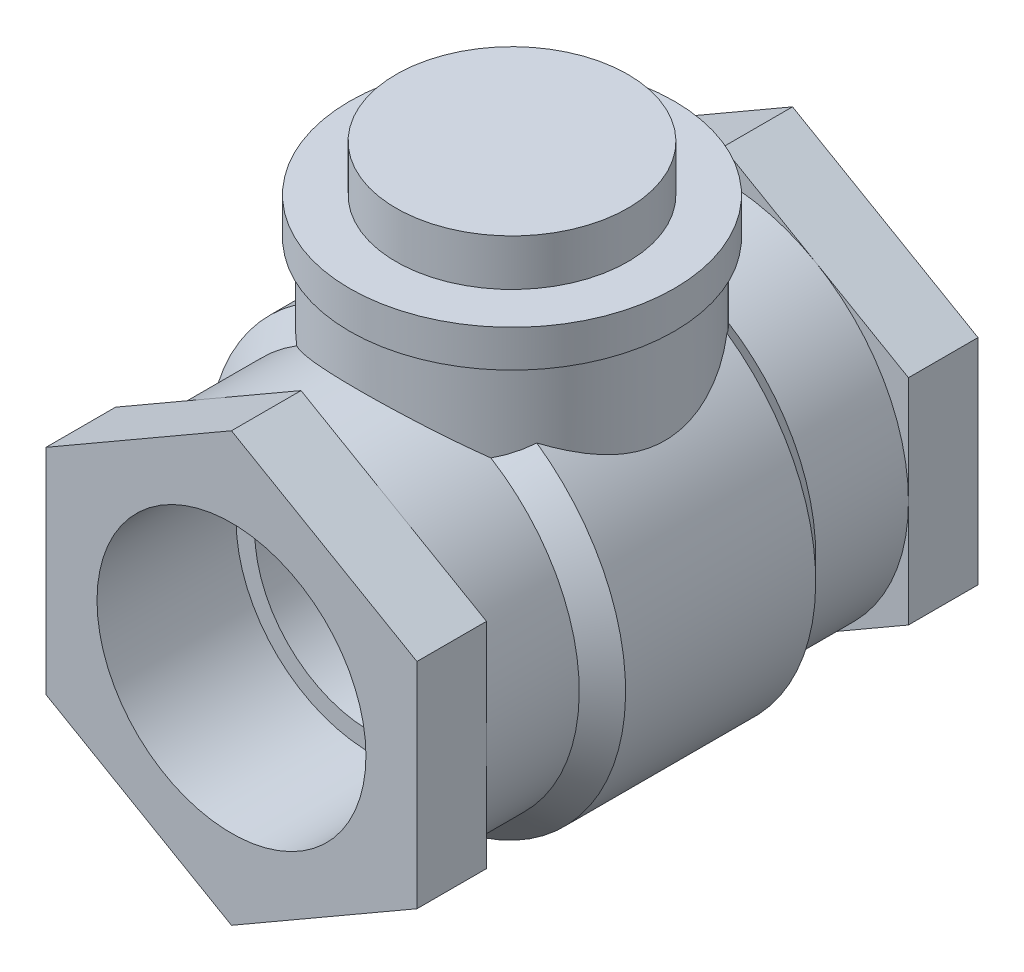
ISO-10303-21;
HEADER;
FILE_DESCRIPTION(('STEP AP214'),'2;1');
FILE_NAME('part.step','',(''),(''),'','','');
FILE_SCHEMA(('AUTOMOTIVE_DESIGN { 1 0 10303 214 1 1 1 1 }'));
ENDSEC;
DATA;
#1=APPLICATION_CONTEXT('core data for automotive mechanical design processes');
#2=APPLICATION_PROTOCOL_DEFINITION('international standard','automotive_design',2000,#1);
#3=PRODUCT_CONTEXT('',#1,'mechanical');
#4=PRODUCT('Part','Part','',(#3));
#5=PRODUCT_RELATED_PRODUCT_CATEGORY('part','',(#4));
#6=PRODUCT_DEFINITION_FORMATION('','',#4);
#7=PRODUCT_DEFINITION_CONTEXT('part definition',#1,'design');
#8=PRODUCT_DEFINITION('design','',#6,#7);
#9=PRODUCT_DEFINITION_SHAPE('','',#8);
#10=(LENGTH_UNIT() NAMED_UNIT(*) SI_UNIT(.MILLI.,.METRE.));
#11=(NAMED_UNIT(*) PLANE_ANGLE_UNIT() SI_UNIT($,.RADIAN.));
#12=(NAMED_UNIT(*) SI_UNIT($,.STERADIAN.) SOLID_ANGLE_UNIT());
#13=UNCERTAINTY_MEASURE_WITH_UNIT(LENGTH_MEASURE(1.E-05),#10,'distance_accuracy_value','');
#14=(GEOMETRIC_REPRESENTATION_CONTEXT(3) GLOBAL_UNCERTAINTY_ASSIGNED_CONTEXT((#13)) GLOBAL_UNIT_ASSIGNED_CONTEXT((#10,
#11,#12)) REPRESENTATION_CONTEXT('',''));
#15=CARTESIAN_POINT('',(0.,0.,0.));
#16=DIRECTION('',(0.,0.,1.));
#17=DIRECTION('',(1.,0.,0.));
#18=AXIS2_PLACEMENT_3D('',#15,#16,#17);
#19=CARTESIAN_POINT('',(50.,0.,-60.5));
#20=DIRECTION('',(0.,0.,1.));
#21=DIRECTION('',(1.,0.,0.));
#22=AXIS2_PLACEMENT_3D('',#19,#20,#21);
#23=PLANE('',#22);
#24=CARTESIAN_POINT('',(0.,0.,-60.5));
#25=DIRECTION('',(0.,0.,-1.));
#26=DIRECTION('',(-1.,0.,0.));
#27=AXIS2_PLACEMENT_3D('',#24,#25,#26);
#28=CIRCLE('',#27,29.);
#29=CARTESIAN_POINT('',(-29.,0.,-60.5));
#30=VERTEX_POINT('',#29);
#31=EDGE_CURVE('E324',#30,#30,#28,.T.);
#32=ORIENTED_EDGE('',*,*,#31,.F.);
#33=EDGE_LOOP('',(#32));
#34=FACE_BOUND('',#33,.T.);
#35=DIRECTION('',(0.,1.,0.));
#36=VECTOR('',#35,1.);
#37=CARTESIAN_POINT('',(-40.,-23.094010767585,-60.5));
#38=LINE('',#37,#36);
#39=CARTESIAN_POINT('',(-40.,-23.094010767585,-60.5));
#40=VERTEX_POINT('',#39);
#41=CARTESIAN_POINT('',(-40.,23.0940107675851,-60.5));
#42=VERTEX_POINT('',#41);
#43=EDGE_CURVE('E65',#40,#42,#38,.T.);
#44=ORIENTED_EDGE('',*,*,#43,.T.);
#45=DIRECTION('',(0.866025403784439,0.5,0.));
#46=VECTOR('',#45,1.);
#47=CARTESIAN_POINT('',(-40.,23.0940107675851,-60.5));
#48=LINE('',#47,#46);
#49=CARTESIAN_POINT('',(0.,46.1880215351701,-60.5));
#50=VERTEX_POINT('',#49);
#51=EDGE_CURVE('E294',#42,#50,#48,.T.);
#52=ORIENTED_EDGE('',*,*,#51,.T.);
#53=DIRECTION('',(0.866025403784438,-0.5,0.));
#54=VECTOR('',#53,1.);
#55=CARTESIAN_POINT('',(0.,46.1880215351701,-60.5));
#56=LINE('',#55,#54);
#57=CARTESIAN_POINT('',(40.,23.094010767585,-60.5));
#58=VERTEX_POINT('',#57);
#59=EDGE_CURVE('E297',#50,#58,#56,.T.);
#60=ORIENTED_EDGE('',*,*,#59,.T.);
#61=DIRECTION('',(0.,-1.,0.));
#62=VECTOR('',#61,1.);
#63=CARTESIAN_POINT('',(40.,23.094010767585,-60.5));
#64=LINE('',#63,#62);
#65=CARTESIAN_POINT('',(40.,-23.094010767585,-60.5));
#66=VERTEX_POINT('',#65);
#67=EDGE_CURVE('E300',#58,#66,#64,.T.);
#68=ORIENTED_EDGE('',*,*,#67,.T.);
#69=DIRECTION('',(-0.866025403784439,-0.5,0.));
#70=VECTOR('',#69,1.);
#71=CARTESIAN_POINT('',(40.,-23.094010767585,-60.5));
#72=LINE('',#71,#70);
#73=CARTESIAN_POINT('',(0.,-46.1880215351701,-60.5));
#74=VERTEX_POINT('',#73);
#75=EDGE_CURVE('E303',#66,#74,#72,.T.);
#76=ORIENTED_EDGE('',*,*,#75,.T.);
#77=DIRECTION('',(-0.866025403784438,0.5,0.));
#78=VECTOR('',#77,1.);
#79=CARTESIAN_POINT('',(0.,-46.1880215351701,-60.5));
#80=LINE('',#79,#78);
#81=EDGE_CURVE('E290',#74,#40,#80,.T.);
#82=ORIENTED_EDGE('',*,*,#81,.T.);
#83=EDGE_LOOP('',(#44,#52,#60,#68,#76,#82));
#84=FACE_BOUND('',#83,.T.);
#85=ADVANCED_FACE('F38',(#34,#84),#23,.F.);
#86=CARTESIAN_POINT('',(40.,0.,-45.5));
#87=DIRECTION('',(0.,0.,-1.));
#88=DIRECTION('',(-1.,0.,0.));
#89=AXIS2_PLACEMENT_3D('',#86,#87,#88);
#90=PLANE('',#89);
#91=DIRECTION('',(0.,-1.,0.));
#92=VECTOR('',#91,1.);
#93=CARTESIAN_POINT('',(-40.,-23.094010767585,-45.5));
#94=LINE('',#93,#92);
#95=CARTESIAN_POINT('',(-40.,0.,-45.5));
#96=VERTEX_POINT('',#95);
#97=CARTESIAN_POINT('',(-40.,-23.094010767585,-45.5));
#98=VERTEX_POINT('',#97);
#99=EDGE_CURVE('E309',#96,#98,#94,.T.);
#100=ORIENTED_EDGE('',*,*,#99,.T.);
#101=DIRECTION('',(0.866025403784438,-0.5,0.));
#102=VECTOR('',#101,1.);
#103=CARTESIAN_POINT('',(0.,-46.1880215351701,-45.5));
#104=LINE('',#103,#102);
#105=CARTESIAN_POINT('',(-20.,-34.6410161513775,-45.5));
#106=VERTEX_POINT('',#105);
#107=EDGE_CURVE('E287',#98,#106,#104,.T.);
#108=ORIENTED_EDGE('',*,*,#107,.T.);
#109=CARTESIAN_POINT('',(0.,0.,-45.5));
#110=DIRECTION('',(0.,0.,-1.));
#111=DIRECTION('',(-1.,0.,0.));
#112=AXIS2_PLACEMENT_3D('',#109,#110,#111);
#113=CIRCLE('',#112,40.);
#114=EDGE_CURVE('E220',#106,#96,#113,.T.);
#115=ORIENTED_EDGE('',*,*,#114,.T.);
#116=EDGE_LOOP('',(#100,#108,#115));
#117=FACE_BOUND('',#116,.T.);
#118=ADVANCED_FACE('F460',(#117),#90,.F.);
#119=CARTESIAN_POINT('',(-40.,23.0940107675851,-45.5));
#120=VERTEX_POINT('',#119);
#121=EDGE_CURVE('E319',#120,#96,#94,.T.);
#122=ORIENTED_EDGE('',*,*,#121,.T.);
#123=CARTESIAN_POINT('',(-20.,34.6410161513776,-45.5));
#124=VERTEX_POINT('',#123);
#125=EDGE_CURVE('E51',#96,#124,#113,.T.);
#126=ORIENTED_EDGE('',*,*,#125,.T.);
#127=DIRECTION('',(-0.866025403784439,-0.5,0.));
#128=VECTOR('',#127,1.);
#129=CARTESIAN_POINT('',(-40.,23.0940107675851,-45.5));
#130=LINE('',#129,#128);
#131=EDGE_CURVE('E267',#124,#120,#130,.T.);
#132=ORIENTED_EDGE('',*,*,#131,.T.);
#133=EDGE_LOOP('',(#122,#126,#132));
#134=FACE_BOUND('',#133,.T.);
#135=ADVANCED_FACE('F465',(#134),#90,.F.);
#136=CARTESIAN_POINT('',(0.,46.1880215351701,-45.5));
#137=VERTEX_POINT('',#136);
#138=EDGE_CURVE('E263',#137,#124,#130,.T.);
#139=ORIENTED_EDGE('',*,*,#138,.T.);
#140=CARTESIAN_POINT('',(20.,34.6410161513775,-45.5));
#141=VERTEX_POINT('',#140);
#142=EDGE_CURVE('E222',#124,#141,#113,.T.);
#143=ORIENTED_EDGE('',*,*,#142,.T.);
#144=DIRECTION('',(-0.866025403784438,0.5,0.));
#145=VECTOR('',#144,1.);
#146=CARTESIAN_POINT('',(0.,46.1880215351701,-45.5));
#147=LINE('',#146,#145);
#148=EDGE_CURVE('E262',#141,#137,#147,.T.);
#149=ORIENTED_EDGE('',*,*,#148,.T.);
#150=EDGE_LOOP('',(#139,#143,#149));
#151=FACE_BOUND('',#150,.T.);
#152=ADVANCED_FACE('F261',(#151),#90,.F.);
#153=CARTESIAN_POINT('',(40.,23.094010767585,-45.5));
#154=VERTEX_POINT('',#153);
#155=EDGE_CURVE('E253',#154,#141,#147,.T.);
#156=ORIENTED_EDGE('',*,*,#155,.T.);
#157=CARTESIAN_POINT('',(40.,0.,-45.5));
#158=VERTEX_POINT('',#157);
#159=EDGE_CURVE('E228',#141,#158,#113,.T.);
#160=ORIENTED_EDGE('',*,*,#159,.T.);
#161=DIRECTION('',(0.,1.,0.));
#162=VECTOR('',#161,1.);
#163=CARTESIAN_POINT('',(40.,23.094010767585,-45.5));
#164=LINE('',#163,#162);
#165=EDGE_CURVE('E252',#158,#154,#164,.T.);
#166=ORIENTED_EDGE('',*,*,#165,.T.);
#167=EDGE_LOOP('',(#156,#160,#166));
#168=FACE_BOUND('',#167,.T.);
#169=ADVANCED_FACE('F251',(#168),#90,.F.);
#170=CARTESIAN_POINT('',(40.,-23.094010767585,-45.5));
#171=VERTEX_POINT('',#170);
#172=EDGE_CURVE('E282',#171,#158,#164,.T.);
#173=ORIENTED_EDGE('',*,*,#172,.T.);
#174=CARTESIAN_POINT('',(20.,-34.6410161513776,-45.5));
#175=VERTEX_POINT('',#174);
#176=EDGE_CURVE('E236',#158,#175,#113,.T.);
#177=ORIENTED_EDGE('',*,*,#176,.T.);
#178=DIRECTION('',(0.866025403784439,0.5,0.));
#179=VECTOR('',#178,1.);
#180=CARTESIAN_POINT('',(40.,-23.094010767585,-45.5));
#181=LINE('',#180,#179);
#182=EDGE_CURVE('E286',#175,#171,#181,.T.);
#183=ORIENTED_EDGE('',*,*,#182,.T.);
#184=EDGE_LOOP('',(#173,#177,#183));
#185=FACE_BOUND('',#184,.T.);
#186=ADVANCED_FACE('F487',(#185),#90,.F.);
#187=CARTESIAN_POINT('',(0.,-46.1880215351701,-45.5));
#188=VERTEX_POINT('',#187);
#189=EDGE_CURVE('E284',#188,#175,#181,.T.);
#190=ORIENTED_EDGE('',*,*,#189,.T.);
#191=EDGE_CURVE('E230',#175,#106,#113,.T.);
#192=ORIENTED_EDGE('',*,*,#191,.T.);
#193=EDGE_CURVE('E289',#106,#188,#104,.T.);
#194=ORIENTED_EDGE('',*,*,#193,.T.);
#195=EDGE_LOOP('',(#190,#192,#194));
#196=FACE_BOUND('',#195,.T.);
#197=ADVANCED_FACE('F466',(#196),#90,.F.);
#198=CARTESIAN_POINT('',(50.,0.,45.5));
#199=DIRECTION('',(0.,0.,1.));
#200=DIRECTION('',(1.,0.,0.));
#201=AXIS2_PLACEMENT_3D('',#198,#199,#200);
#202=PLANE('',#201);
#203=DIRECTION('',(0.,-1.,0.));
#204=VECTOR('',#203,1.);
#205=CARTESIAN_POINT('',(40.,-23.094010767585,45.5));
#206=LINE('',#205,#204);
#207=CARTESIAN_POINT('',(40.,0.,45.5));
#208=VERTEX_POINT('',#207);
#209=CARTESIAN_POINT('',(40.,-23.094010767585,45.5));
#210=VERTEX_POINT('',#209);
#211=EDGE_CURVE('E359',#208,#210,#206,.T.);
#212=ORIENTED_EDGE('',*,*,#211,.T.);
#213=DIRECTION('',(-0.866025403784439,-0.5,0.));
#214=VECTOR('',#213,1.);
#215=CARTESIAN_POINT('',(0.,-46.1880215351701,45.5));
#216=LINE('',#215,#214);
#217=CARTESIAN_POINT('',(20.,-34.6410161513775,45.5));
#218=VERTEX_POINT('',#217);
#219=EDGE_CURVE('E338',#210,#218,#216,.T.);
#220=ORIENTED_EDGE('',*,*,#219,.T.);
#221=CARTESIAN_POINT('',(0.,0.,45.5));
#222=DIRECTION('',(0.,0.,-1.));
#223=DIRECTION('',(-1.,0.,0.));
#224=AXIS2_PLACEMENT_3D('',#221,#222,#223);
#225=CIRCLE('',#224,40.);
#226=EDGE_CURVE('E395',#208,#218,#225,.T.);
#227=ORIENTED_EDGE('',*,*,#226,.F.);
#228=EDGE_LOOP('',(#212,#220,#227));
#229=FACE_BOUND('',#228,.T.);
#230=ADVANCED_FACE('F416',(#229),#202,.F.);
#231=CARTESIAN_POINT('',(40.,23.0940107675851,45.5));
#232=VERTEX_POINT('',#231);
#233=EDGE_CURVE('E370',#232,#208,#206,.T.);
#234=ORIENTED_EDGE('',*,*,#233,.T.);
#235=CARTESIAN_POINT('',(20.,34.6410161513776,45.5));
#236=VERTEX_POINT('',#235);
#237=EDGE_CURVE('E398',#236,#208,#225,.T.);
#238=ORIENTED_EDGE('',*,*,#237,.F.);
#239=DIRECTION('',(0.866025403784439,-0.5,0.));
#240=VECTOR('',#239,1.);
#241=CARTESIAN_POINT('',(40.,23.0940107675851,45.5));
#242=LINE('',#241,#240);
#243=EDGE_CURVE('E325',#236,#232,#242,.T.);
#244=ORIENTED_EDGE('',*,*,#243,.T.);
#245=EDGE_LOOP('',(#234,#238,#244));
#246=FACE_BOUND('',#245,.T.);
#247=ADVANCED_FACE('F411',(#246),#202,.F.);
#248=CARTESIAN_POINT('',(0.,46.1880215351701,45.5));
#249=VERTEX_POINT('',#248);
#250=EDGE_CURVE('E321',#249,#236,#242,.T.);
#251=ORIENTED_EDGE('',*,*,#250,.T.);
#252=CARTESIAN_POINT('',(-20.,34.6410161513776,45.5));
#253=VERTEX_POINT('',#252);
#254=EDGE_CURVE('E211',#253,#236,#225,.T.);
#255=ORIENTED_EDGE('',*,*,#254,.F.);
#256=DIRECTION('',(0.866025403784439,0.5,0.));
#257=VECTOR('',#256,1.);
#258=CARTESIAN_POINT('',(0.,46.1880215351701,45.5));
#259=LINE('',#258,#257);
#260=EDGE_CURVE('E329',#253,#249,#259,.T.);
#261=ORIENTED_EDGE('',*,*,#260,.T.);
#262=EDGE_LOOP('',(#251,#255,#261));
#263=FACE_BOUND('',#262,.T.);
#264=ADVANCED_FACE('F406',(#263),#202,.F.);
#265=CARTESIAN_POINT('',(-40.,23.094010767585,45.5));
#266=VERTEX_POINT('',#265);
#267=EDGE_CURVE('E326',#266,#253,#259,.T.);
#268=ORIENTED_EDGE('',*,*,#267,.T.);
#269=CARTESIAN_POINT('',(-40.,0.,45.5));
#270=VERTEX_POINT('',#269);
#271=EDGE_CURVE('E206',#270,#253,#225,.T.);
#272=ORIENTED_EDGE('',*,*,#271,.F.);
#273=DIRECTION('',(0.,1.,0.));
#274=VECTOR('',#273,1.);
#275=CARTESIAN_POINT('',(-40.,23.094010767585,45.5));
#276=LINE('',#275,#274);
#277=EDGE_CURVE('E333',#270,#266,#276,.T.);
#278=ORIENTED_EDGE('',*,*,#277,.T.);
#279=EDGE_LOOP('',(#268,#272,#278));
#280=FACE_BOUND('',#279,.T.);
#281=ADVANCED_FACE('F441',(#280),#202,.F.);
#282=CARTESIAN_POINT('',(-40.,-23.094010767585,45.5));
#283=VERTEX_POINT('',#282);
#284=EDGE_CURVE('E330',#283,#270,#276,.T.);
#285=ORIENTED_EDGE('',*,*,#284,.T.);
#286=CARTESIAN_POINT('',(-20.,-34.6410161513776,45.5));
#287=VERTEX_POINT('',#286);
#288=EDGE_CURVE('E213',#287,#270,#225,.T.);
#289=ORIENTED_EDGE('',*,*,#288,.F.);
#290=DIRECTION('',(-0.866025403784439,0.5,0.));
#291=VECTOR('',#290,1.);
#292=CARTESIAN_POINT('',(-40.,-23.094010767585,45.5));
#293=LINE('',#292,#291);
#294=EDGE_CURVE('E337',#287,#283,#293,.T.);
#295=ORIENTED_EDGE('',*,*,#294,.T.);
#296=EDGE_LOOP('',(#285,#289,#295));
#297=FACE_BOUND('',#296,.T.);
#298=ADVANCED_FACE('F426',(#297),#202,.F.);
#299=CARTESIAN_POINT('',(0.,-46.1880215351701,45.5));
#300=VERTEX_POINT('',#299);
#301=EDGE_CURVE('E334',#300,#287,#293,.T.);
#302=ORIENTED_EDGE('',*,*,#301,.T.);
#303=EDGE_CURVE('E391',#218,#287,#225,.T.);
#304=ORIENTED_EDGE('',*,*,#303,.F.);
#305=EDGE_CURVE('E340',#218,#300,#216,.T.);
#306=ORIENTED_EDGE('',*,*,#305,.T.);
#307=EDGE_LOOP('',(#302,#304,#306));
#308=FACE_BOUND('',#307,.T.);
#309=ADVANCED_FACE('F421',(#308),#202,.F.);
#310=CARTESIAN_POINT('',(29.,0.,60.5));
#311=DIRECTION('',(0.,0.,-1.));
#312=DIRECTION('',(-1.,0.,0.));
#313=AXIS2_PLACEMENT_3D('',#310,#311,#312);
#314=PLANE('',#313);
#315=CARTESIAN_POINT('',(0.,0.,60.5));
#316=DIRECTION('',(0.,0.,-1.));
#317=DIRECTION('',(-1.,0.,0.));
#318=AXIS2_PLACEMENT_3D('',#315,#316,#317);
#319=CIRCLE('',#318,29.);
#320=CARTESIAN_POINT('',(-29.,0.,60.5));
#321=VERTEX_POINT('',#320);
#322=EDGE_CURVE('E386',#321,#321,#319,.T.);
#323=ORIENTED_EDGE('',*,*,#322,.T.);
#324=EDGE_LOOP('',(#323));
#325=FACE_BOUND('',#324,.T.);
#326=DIRECTION('',(0.,1.,0.));
#327=VECTOR('',#326,1.);
#328=CARTESIAN_POINT('',(40.,-23.094010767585,60.5));
#329=LINE('',#328,#327);
#330=CARTESIAN_POINT('',(40.,-23.094010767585,60.5));
#331=VERTEX_POINT('',#330);
#332=CARTESIAN_POINT('',(40.,23.0940107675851,60.5));
#333=VERTEX_POINT('',#332);
#334=EDGE_CURVE('E270',#331,#333,#329,.T.);
#335=ORIENTED_EDGE('',*,*,#334,.T.);
#336=DIRECTION('',(-0.866025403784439,0.5,0.));
#337=VECTOR('',#336,1.);
#338=CARTESIAN_POINT('',(40.,23.0940107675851,60.5));
#339=LINE('',#338,#337);
#340=CARTESIAN_POINT('',(0.,46.1880215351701,60.5));
#341=VERTEX_POINT('',#340);
#342=EDGE_CURVE('E344',#333,#341,#339,.T.);
#343=ORIENTED_EDGE('',*,*,#342,.T.);
#344=DIRECTION('',(-0.866025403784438,-0.5,0.));
#345=VECTOR('',#344,1.);
#346=CARTESIAN_POINT('',(0.,46.1880215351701,60.5));
#347=LINE('',#346,#345);
#348=CARTESIAN_POINT('',(-40.,23.094010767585,60.5));
#349=VERTEX_POINT('',#348);
#350=EDGE_CURVE('E347',#341,#349,#347,.T.);
#351=ORIENTED_EDGE('',*,*,#350,.T.);
#352=DIRECTION('',(0.,-1.,0.));
#353=VECTOR('',#352,1.);
#354=CARTESIAN_POINT('',(-40.,23.094010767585,60.5));
#355=LINE('',#354,#353);
#356=CARTESIAN_POINT('',(-40.,-23.094010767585,60.5));
#357=VERTEX_POINT('',#356);
#358=EDGE_CURVE('E350',#349,#357,#355,.T.);
#359=ORIENTED_EDGE('',*,*,#358,.T.);
#360=DIRECTION('',(0.866025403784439,-0.5,0.));
#361=VECTOR('',#360,1.);
#362=CARTESIAN_POINT('',(-40.,-23.094010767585,60.5));
#363=LINE('',#362,#361);
#364=CARTESIAN_POINT('',(0.,-46.1880215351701,60.5));
#365=VERTEX_POINT('',#364);
#366=EDGE_CURVE('E353',#357,#365,#363,.T.);
#367=ORIENTED_EDGE('',*,*,#366,.T.);
#368=DIRECTION('',(0.866025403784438,0.5,0.));
#369=VECTOR('',#368,1.);
#370=CARTESIAN_POINT('',(0.,-46.1880215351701,60.5));
#371=LINE('',#370,#369);
#372=EDGE_CURVE('E266',#365,#331,#371,.T.);
#373=ORIENTED_EDGE('',*,*,#372,.T.);
#374=EDGE_LOOP('',(#335,#343,#351,#359,#367,#373));
#375=FACE_BOUND('',#374,.T.);
#376=ADVANCED_FACE('F437',(#325,#375),#314,.F.);
#377=CARTESIAN_POINT('',(0.,0.,-91.));
#378=DIRECTION('',(0.,0.,-1.));
#379=DIRECTION('',(-1.,0.,0.));
#380=AXIS2_PLACEMENT_3D('',#377,#378,#379);
#381=CYLINDRICAL_SURFACE('',#380,40.);
#382=ORIENTED_EDGE('',*,*,#125,.F.);
#383=ORIENTED_EDGE('',*,*,#114,.F.);
#384=ORIENTED_EDGE('',*,*,#191,.F.);
#385=ORIENTED_EDGE('',*,*,#176,.F.);
#386=ORIENTED_EDGE('',*,*,#159,.F.);
#387=ORIENTED_EDGE('',*,*,#142,.F.);
#388=EDGE_LOOP('',(#382,#383,#384,#385,#386,#387));
#389=FACE_BOUND('',#388,.T.);
#390=CARTESIAN_POINT('',(0.,0.,-25.5));
#391=DIRECTION('',(0.,0.,-1.));
#392=DIRECTION('',(-1.,0.,0.));
#393=AXIS2_PLACEMENT_3D('',#390,#391,#392);
#394=CIRCLE('',#393,40.);
#395=CARTESIAN_POINT('',(20.9463600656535,34.0771184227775,-25.5));
#396=VERTEX_POINT('',#395);
#397=CARTESIAN_POINT('',(-20.9463600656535,34.0771184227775,-25.5));
#398=VERTEX_POINT('',#397);
#399=EDGE_CURVE('E218',#396,#398,#394,.T.);
#400=ORIENTED_EDGE('',*,*,#399,.T.);
#401=CARTESIAN_POINT('',(-20.9463600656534,34.0771184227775,-25.5));
#402=CARTESIAN_POINT('',(-20.3345752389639,34.4532174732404,-26.0025107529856));
#403=CARTESIAN_POINT('',(-19.7010222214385,34.819893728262,-26.4860752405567));
#404=CARTESIAN_POINT('',(-18.3907887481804,35.5293346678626,-27.4121059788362));
#405=CARTESIAN_POINT('',(-17.7140650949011,35.8720746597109,-27.8545299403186));
#406=CARTESIAN_POINT('',(-16.3130419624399,36.5306603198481,-28.6977116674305));
#407=CARTESIAN_POINT('',(-15.5883778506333,36.8462442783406,-29.0980707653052));
#408=CARTESIAN_POINT('',(-14.0992457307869,37.4413388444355,-29.848048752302));
#409=CARTESIAN_POINT('',(-13.3347891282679,37.7208597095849,-30.1976820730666));
#410=CARTESIAN_POINT('',(-11.7639498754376,38.240007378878,-30.8437246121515));
#411=CARTESIAN_POINT('',(-10.9573210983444,38.4793549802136,-31.1397623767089));
#412=CARTESIAN_POINT('',(-9.31165360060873,38.9103643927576,-31.6708152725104));
#413=CARTESIAN_POINT('',(-8.47261222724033,39.1020222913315,-31.9058253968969));
#414=CARTESIAN_POINT('',(-6.77210498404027,39.432037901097,-32.3094267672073));
#415=CARTESIAN_POINT('',(-5.91074421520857,39.5706092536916,-32.4782843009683));
#416=CARTESIAN_POINT('',(-4.17030971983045,39.7916761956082,-32.7472655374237));
#417=CARTESIAN_POINT('',(-3.29123943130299,39.8741825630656,-32.8474024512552));
#418=CARTESIAN_POINT('',(-1.64121726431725,39.9737004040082,-32.9681311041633));
#419=CARTESIAN_POINT('',(-0.871323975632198,39.9979242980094,-32.9974837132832));
#420=CARTESIAN_POINT('',(0.66870703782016,40.0018191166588,-33.0022052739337));
#421=CARTESIAN_POINT('',(1.43884473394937,39.9814940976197,-32.9775791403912));
#422=CARTESIAN_POINT('',(2.97340476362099,39.8967385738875,-32.8747712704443));
#423=CARTESIAN_POINT('',(3.73782439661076,39.8322884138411,-32.7965656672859));
#424=CARTESIAN_POINT('',(5.2546192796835,39.6607047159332,-32.5879581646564));
#425=CARTESIAN_POINT('',(6.0069946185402,39.5535714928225,-32.4575566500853));
#426=CARTESIAN_POINT('',(7.44768835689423,39.3068984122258,-32.1564801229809));
#427=CARTESIAN_POINT('',(8.13706730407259,39.1698086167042,-31.9888391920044));
#428=CARTESIAN_POINT('',(9.49672098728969,38.8625533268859,-31.6118645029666));
#429=CARTESIAN_POINT('',(10.1669963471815,38.6923889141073,-31.4025321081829));
#430=CARTESIAN_POINT('',(11.4860709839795,38.3215362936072,-30.9444379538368));
#431=CARTESIAN_POINT('',(12.1348458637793,38.1208147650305,-30.6956331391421));
#432=CARTESIAN_POINT('',(13.4077061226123,37.6919680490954,-30.1613963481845));
#433=CARTESIAN_POINT('',(14.0317922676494,37.4638437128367,-29.8759655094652));
#434=CARTESIAN_POINT('',(15.2184328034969,36.9970570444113,-29.2884313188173));
#435=CARTESIAN_POINT('',(15.7824634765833,36.759749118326,-28.9882225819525));
#436=CARTESIAN_POINT('',(16.8859689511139,36.2660923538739,-28.3596066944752));
#437=CARTESIAN_POINT('',(17.4254419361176,36.0097421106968,-28.0311974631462));
#438=CARTESIAN_POINT('',(18.4767599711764,35.4817392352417,-27.3495925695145));
#439=CARTESIAN_POINT('',(18.9887142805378,35.2101574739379,-26.9965100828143));
#440=CARTESIAN_POINT('',(19.9868814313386,34.6533017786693,-26.266074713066));
#441=CARTESIAN_POINT('',(20.4731043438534,34.3680332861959,-25.888731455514));
#442=CARTESIAN_POINT('',(20.9463600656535,34.0771184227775,-25.5));
#443=B_SPLINE_CURVE_WITH_KNOTS('',3,(#401,#402,#403,#404,#405,#406,#407,#408,#409,#410,#411,
#412,#413,#414,#415,#416,#417,#418,#419,#420,#421,#422,#423,#424,#425,#426,#427,#428,#429,#430,
#431,#432,#433,#434,#435,#436,#437,#438,#439,#440,#441,#442),.UNSPECIFIED.,.F.,.F.,(4,2,2,2,2,2,
2,2,2,2,2,2,2,2,2,2,2,2,2,2,4),(0.,2.62940022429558,5.2614740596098,7.91659001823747,
10.5709491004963,13.243053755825,15.9153775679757,18.5768309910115,21.2377726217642,
23.5471846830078,25.8563864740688,28.1666175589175,30.4768316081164,32.6423467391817,
34.8077910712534,36.9756138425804,39.1433693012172,41.1868189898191,43.2304195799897,
45.2651940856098,47.2991662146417),.UNSPECIFIED.);
#444=EDGE_CURVE('E274',#398,#396,#443,.T.);
#445=ORIENTED_EDGE('',*,*,#444,.T.);
#446=EDGE_LOOP('',(#400,#445));
#447=FACE_BOUND('',#446,.T.);
#448=ADVANCED_FACE('F256',(#389,#447),#381,.T.);
#449=CARTESIAN_POINT('',(0.,0.,-20.5));
#450=DIRECTION('',(0.,0.,1.));
#451=DIRECTION('',(1.,0.,0.));
#452=AXIS2_PLACEMENT_3D('',#449,#450,#451);
#453=CONICAL_SURFACE('',#452,45.,0.78539816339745);
#454=CARTESIAN_POINT('',(0.,0.,-20.5));
#455=DIRECTION('',(0.,0.,-1.));
#456=DIRECTION('',(-1.,0.,0.));
#457=AXIS2_PLACEMENT_3D('',#454,#455,#456);
#458=CIRCLE('',#457,45.);
#459=CARTESIAN_POINT('',(25.8602010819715,36.8272996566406,-20.5));
#460=VERTEX_POINT('',#459);
#461=CARTESIAN_POINT('',(-25.8602010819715,36.8272996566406,-20.5));
#462=VERTEX_POINT('',#461);
#463=EDGE_CURVE('E208',#460,#462,#458,.T.);
#464=ORIENTED_EDGE('',*,*,#463,.T.);
#465=CARTESIAN_POINT('',(-26.2489618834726,37.1653090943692,-19.9998));
#466=CARTESIAN_POINT('',(-26.0464591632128,36.9829264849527,-20.2655831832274));
#467=CARTESIAN_POINT('',(-25.8382411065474,36.8055492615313,-20.5304813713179));
#468=CARTESIAN_POINT('',(-25.4102691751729,36.4613243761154,-21.057860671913));
#469=CARTESIAN_POINT('',(-25.1905136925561,36.2944781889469,-21.3203414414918));
#470=CARTESIAN_POINT('',(-24.7411835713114,35.9731478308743,-21.8401221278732));
#471=CARTESIAN_POINT('',(-24.5116992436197,35.8185771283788,-22.0974465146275));
#472=CARTESIAN_POINT('',(-24.0413765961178,35.5207987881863,-22.6082446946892));
#473=CARTESIAN_POINT('',(-23.800538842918,35.3775905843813,-22.861718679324));
#474=CARTESIAN_POINT('',(-23.3076066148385,35.1028407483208,-23.3640601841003));
#475=CARTESIAN_POINT('',(-23.0555111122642,34.9713001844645,-23.6129272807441));
#476=CARTESIAN_POINT('',(-22.5403131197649,34.7200848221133,-24.1052119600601));
#477=CARTESIAN_POINT('',(-22.2772104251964,34.6004102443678,-24.348629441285));
#478=CARTESIAN_POINT('',(-21.7382185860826,34.3720839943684,-24.8310616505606));
#479=CARTESIAN_POINT('',(-21.4622452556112,34.2635262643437,-25.070026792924));
#480=CARTESIAN_POINT('',(-20.8998899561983,34.0583491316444,-25.5407378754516));
#481=CARTESIAN_POINT('',(-20.6135077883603,33.9617299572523,-25.7724836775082));
#482=CARTESIAN_POINT('',(-20.3221455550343,33.8709993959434,-26.0002));
#483=B_SPLINE_CURVE_WITH_KNOTS('',3,(#465,#466,#467,#468,#469,#470,#471,#472,#473,#474,#475,
#476,#477,#478,#479,#480,#481,#482),.UNSPECIFIED.,.F.,.F.,(4,2,2,2,2,2,2,2,4),(0.,
1.14197688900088,2.28411335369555,3.41731085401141,4.5504518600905,5.68369652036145,
6.81696225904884,7.95912745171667,9.10131448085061),.UNSPECIFIED.);
#484=EDGE_CURVE('E512',#462,#398,#483,.T.);
#485=ORIENTED_EDGE('',*,*,#484,.T.);
#486=ORIENTED_EDGE('',*,*,#399,.F.);
#487=CARTESIAN_POINT('',(20.3221455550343,33.8709993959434,-26.0002));
#488=CARTESIAN_POINT('',(20.6135077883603,33.9617299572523,-25.7724836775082));
#489=CARTESIAN_POINT('',(20.8998899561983,34.0583491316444,-25.5407378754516));
#490=CARTESIAN_POINT('',(21.4622452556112,34.2635262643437,-25.070026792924));
#491=CARTESIAN_POINT('',(21.7382185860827,34.3720839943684,-24.8310616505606));
#492=CARTESIAN_POINT('',(22.2772104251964,34.6004102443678,-24.348629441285));
#493=CARTESIAN_POINT('',(22.5403131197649,34.7200848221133,-24.1052119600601));
#494=CARTESIAN_POINT('',(23.0555111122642,34.9713001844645,-23.6129272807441));
#495=CARTESIAN_POINT('',(23.3076066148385,35.1028407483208,-23.3640601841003));
#496=CARTESIAN_POINT('',(23.800538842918,35.3775905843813,-22.861718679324));
#497=CARTESIAN_POINT('',(24.0413765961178,35.5207987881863,-22.6082446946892));
#498=CARTESIAN_POINT('',(24.5116992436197,35.8185771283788,-22.0974465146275));
#499=CARTESIAN_POINT('',(24.7411835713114,35.9731478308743,-21.8401221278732));
#500=CARTESIAN_POINT('',(25.1905136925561,36.2944781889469,-21.3203414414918));
#501=CARTESIAN_POINT('',(25.4102691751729,36.4613243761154,-21.057860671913));
#502=CARTESIAN_POINT('',(25.8382411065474,36.8055492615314,-20.5304813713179));
#503=CARTESIAN_POINT('',(26.0464591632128,36.9829264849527,-20.2655831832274));
#504=CARTESIAN_POINT('',(26.2489618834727,37.1653090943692,-19.9998));
#505=B_SPLINE_CURVE_WITH_KNOTS('',3,(#487,#488,#489,#490,#491,#492,#493,#494,#495,#496,#497,
#498,#499,#500,#501,#502,#503,#504),.UNSPECIFIED.,.F.,.F.,(4,2,2,2,2,2,2,2,4),(0.,
1.14218702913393,2.28435222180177,3.41761796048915,4.5508626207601,5.68400362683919,
6.81720112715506,7.95933759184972,9.1013144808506),.UNSPECIFIED.);
#506=EDGE_CURVE('E506',#396,#460,#505,.T.);
#507=ORIENTED_EDGE('',*,*,#506,.T.);
#508=EDGE_LOOP('',(#464,#485,#486,#507));
#509=FACE_BOUND('',#508,.T.);
#510=ADVANCED_FACE('F496',(#509),#453,.T.);
#511=CARTESIAN_POINT('',(0.,0.,-91.));
#512=DIRECTION('',(0.,0.,-1.));
#513=DIRECTION('',(-1.,0.,0.));
#514=AXIS2_PLACEMENT_3D('',#511,#512,#513);
#515=CYLINDRICAL_SURFACE('',#514,45.);
#516=ORIENTED_EDGE('',*,*,#463,.F.);
#517=CARTESIAN_POINT('',(0.,45.,-33.));
#518=CARTESIAN_POINT('',(0.810325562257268,44.999991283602,-32.9999908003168));
#519=CARTESIAN_POINT('',(1.62086529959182,44.9780581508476,-32.9700987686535));
#520=CARTESIAN_POINT('',(3.23557074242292,44.8908187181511,-32.8509847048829));
#521=CARTESIAN_POINT('',(4.03973235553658,44.8254865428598,-32.7617272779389));
#522=CARTESIAN_POINT('',(5.63670085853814,44.6528160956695,-32.5250757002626));
#523=CARTESIAN_POINT('',(6.42947878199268,44.5453854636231,-32.3775537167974));
#524=CARTESIAN_POINT('',(7.99593091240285,44.2910234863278,-32.0266973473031));
#525=CARTESIAN_POINT('',(8.76960768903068,44.1440974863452,-31.8233705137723));
#526=CARTESIAN_POINT('',(10.2884679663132,43.8149257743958,-31.3651551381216));
#527=CARTESIAN_POINT('',(11.0337945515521,43.6328972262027,-31.1105832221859));
#528=CARTESIAN_POINT('',(12.4968939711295,43.2365835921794,-30.5522637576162));
#529=CARTESIAN_POINT('',(13.2146659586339,43.0222975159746,-30.2485146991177));
#530=CARTESIAN_POINT('',(14.6191774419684,42.5655355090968,-29.5952582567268));
#531=CARTESIAN_POINT('',(15.3059326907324,42.3230741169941,-29.2457744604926));
#532=CARTESIAN_POINT('',(16.6466526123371,41.8139111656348,-28.5039640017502));
#533=CARTESIAN_POINT('',(17.3006129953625,41.5472064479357,-28.1116317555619));
#534=CARTESIAN_POINT('',(18.2846229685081,41.1195353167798,-27.4744235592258));
#535=CARTESIAN_POINT('',(18.6268832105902,40.9655626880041,-27.2435095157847));
#536=CARTESIAN_POINT('',(19.3008277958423,40.6523810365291,-26.7702733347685));
#537=CARTESIAN_POINT('',(19.6325144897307,40.4931731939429,-26.5279537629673));
#538=CARTESIAN_POINT('',(20.6116322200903,40.0086346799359,-25.7843451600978));
#539=CARTESIAN_POINT('',(21.2431274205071,39.6763861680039,-25.2664020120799));
#540=CARTESIAN_POINT('',(22.4631040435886,38.9986755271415,-24.1882775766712));
#541=CARTESIAN_POINT('',(23.0515218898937,38.6531949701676,-23.6280362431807));
#542=CARTESIAN_POINT('',(24.1835517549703,37.9552106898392,-22.4680353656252));
#543=CARTESIAN_POINT('',(24.7271613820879,37.6027065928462,-21.8682737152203));
#544=CARTESIAN_POINT('',(25.8699447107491,36.8281184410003,-20.5104666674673));
#545=CARTESIAN_POINT('',(26.459381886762,36.4058272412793,-19.7443140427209));
#546=CARTESIAN_POINT('',(27.5712807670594,35.5711655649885,-18.1593466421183));
#547=CARTESIAN_POINT('',(28.093723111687,35.1587979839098,-17.3405167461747));
#548=CARTESIAN_POINT('',(29.0680944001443,34.3575786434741,-15.6523100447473));
#549=CARTESIAN_POINT('',(29.5201015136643,33.9687011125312,-14.7829907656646));
#550=CARTESIAN_POINT('',(30.3499697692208,33.2293238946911,-12.9942402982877));
#551=CARTESIAN_POINT('',(30.7278724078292,32.8788027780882,-12.0748375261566));
#552=CARTESIAN_POINT('',(31.2911367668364,32.3413358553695,-10.5028965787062));
#553=CARTESIAN_POINT('',(31.4986875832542,32.138814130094,-9.86357121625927));
#554=CARTESIAN_POINT('',(31.8762513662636,31.7643713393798,-8.56513229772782));
#555=CARTESIAN_POINT('',(32.0462701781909,31.5924455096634,-7.90602184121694));
#556=CARTESIAN_POINT('',(32.346245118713,31.2852450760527,-6.57168432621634));
#557=CARTESIAN_POINT('',(32.4762786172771,31.149899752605,-5.89649115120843));
#558=CARTESIAN_POINT('',(32.6945701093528,30.9207090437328,-4.53233794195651));
#559=CARTESIAN_POINT('',(32.7828282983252,30.8268634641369,-3.84337797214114));
#560=CARTESIAN_POINT('',(32.9163361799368,30.6842720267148,-2.45104933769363));
#561=CARTESIAN_POINT('',(32.9612410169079,30.6358878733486,-1.74760987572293));
#562=CARTESIAN_POINT('',(33.0058092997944,30.587867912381,-0.337641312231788));
#563=CARTESIAN_POINT('',(33.0054745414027,30.588230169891,0.368887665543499));
#564=CARTESIAN_POINT('',(32.9595610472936,30.6376963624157,1.77915329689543));
#565=CARTESIAN_POINT('',(32.9139556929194,30.6868289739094,2.48288806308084));
#566=CARTESIAN_POINT('',(32.778492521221,30.8314792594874,3.88124955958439));
#567=CARTESIAN_POINT('',(32.6886297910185,30.9270020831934,4.57587526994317));
#568=CARTESIAN_POINT('',(32.4543880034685,31.1728169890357,6.02567838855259));
#569=CARTESIAN_POINT('',(32.3051521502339,31.3279266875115,6.77924922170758));
#570=CARTESIAN_POINT('',(31.9575461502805,31.6824344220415,8.2642080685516));
#571=CARTESIAN_POINT('',(31.7591690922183,31.881838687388,8.99559294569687));
#572=CARTESIAN_POINT('',(31.3159614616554,32.3172882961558,10.4344844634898));
#573=CARTESIAN_POINT('',(31.071040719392,32.5534045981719,11.1419415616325));
#574=CARTESIAN_POINT('',(30.5377991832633,33.0541471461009,12.5297893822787));
#575=CARTESIAN_POINT('',(30.249474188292,33.3187761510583,13.2101774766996));
#576=CARTESIAN_POINT('',(29.523694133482,33.9656131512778,14.7761477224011));
#577=CARTESIAN_POINT('',(29.0693422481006,34.3565838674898,15.6503089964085));
#578=CARTESIAN_POINT('',(28.0899739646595,35.1618494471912,17.3468510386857));
#579=CARTESIAN_POINT('',(27.5649346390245,35.5761518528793,18.1692148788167));
#580=CARTESIAN_POINT('',(26.4465658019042,36.415221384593,19.7617463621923));
#581=CARTESIAN_POINT('',(25.8531727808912,36.8399979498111,20.5318643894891));
#582=CARTESIAN_POINT('',(24.6005101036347,37.6880228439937,22.0172352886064));
#583=CARTESIAN_POINT('',(23.9412479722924,38.111271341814,22.7324944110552));
#584=CARTESIAN_POINT('',(22.5484566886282,38.9517385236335,24.115211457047));
#585=CARTESIAN_POINT('',(21.8140077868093,39.3687868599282,24.7818487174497));
#586=CARTESIAN_POINT('',(20.2804415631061,40.180300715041,26.051775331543));
#587=CARTESIAN_POINT('',(19.4813173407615,40.5747638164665,26.6550579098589));
#588=CARTESIAN_POINT('',(17.8221915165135,41.3303534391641,27.7916888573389));
#589=CARTESIAN_POINT('',(16.9623112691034,41.6915432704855,28.3251708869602));
#590=CARTESIAN_POINT('',(15.6292340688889,42.2013465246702,29.0686429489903));
#591=CARTESIAN_POINT('',(15.1777096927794,42.3659368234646,29.3069888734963));
#592=CARTESIAN_POINT('',(14.2606116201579,42.6833738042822,29.7640297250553));
#593=CARTESIAN_POINT('',(13.7950344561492,42.8362175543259,29.9827197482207));
#594=CARTESIAN_POINT('',(12.6204999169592,43.2002716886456,30.5010198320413));
#595=CARTESIAN_POINT('',(11.9035163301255,43.4036225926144,30.7881214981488));
#596=CARTESIAN_POINT('',(10.4436759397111,43.7778146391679,31.3134324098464));
#597=CARTESIAN_POINT('',(9.70082489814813,43.9486629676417,31.5516524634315));
#598=CARTESIAN_POINT('',(8.57045201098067,44.1779957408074,31.8700591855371));
#599=CARTESIAN_POINT('',(8.19101800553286,44.249944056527,31.9696993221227));
#600=CARTESIAN_POINT('',(7.4273499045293,44.3845107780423,32.1556980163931));
#601=CARTESIAN_POINT('',(7.04311669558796,44.4471308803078,32.2420589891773));
#602=CARTESIAN_POINT('',(5.88397038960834,44.6204975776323,32.4807775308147));
#603=CARTESIAN_POINT('',(5.10252860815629,44.7167673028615,32.6127938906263));
#604=CARTESIAN_POINT('',(3.52522339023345,44.8687332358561,32.8208511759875));
#605=CARTESIAN_POINT('',(2.72931519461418,44.9242677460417,32.8966690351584));
#606=CARTESIAN_POINT('',(1.1322268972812,44.9928523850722,32.9902681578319));
#607=CARTESIAN_POINT('',(0.331046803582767,45.0059025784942,33.0080495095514));
#608=CARTESIAN_POINT('',(-1.27003467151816,44.9891989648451,32.9852706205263));
#609=CARTESIAN_POINT('',(-2.06993603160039,44.9594444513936,32.9447094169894));
#610=CARTESIAN_POINT('',(-3.66198762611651,44.8578425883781,32.8059183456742));
#611=CARTESIAN_POINT('',(-4.45413809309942,44.7859965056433,32.7076902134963));
#612=CARTESIAN_POINT('',(-5.97690046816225,44.607491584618,32.4628226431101));
#613=CARTESIAN_POINT('',(-6.70832821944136,44.5032116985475,32.3194852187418));
#614=CARTESIAN_POINT('',(-8.1544872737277,44.2610644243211,31.9852324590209));
#615=CARTESIAN_POINT('',(-8.86921939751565,44.1231986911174,31.7943194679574));
#616=CARTESIAN_POINT('',(-10.2782089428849,43.8164168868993,31.3671877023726));
#617=CARTESIAN_POINT('',(-10.972464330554,43.6474977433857,31.1309644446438));
#618=CARTESIAN_POINT('',(-12.3372616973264,43.2815346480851,30.6157494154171));
#619=CARTESIAN_POINT('',(-13.0078023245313,43.0844890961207,30.336755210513));
#620=CARTESIAN_POINT('',(-14.3749265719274,42.648755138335,29.7148014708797));
#621=CARTESIAN_POINT('',(-15.0693385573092,42.40800098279,29.3685190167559));
#622=CARTESIAN_POINT('',(-16.4251018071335,41.9015490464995,28.6323449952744));
#623=CARTESIAN_POINT('',(-17.0864516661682,41.6358502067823,28.242451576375));
#624=CARTESIAN_POINT('',(-18.374618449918,41.0836306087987,27.4218323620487));
#625=CARTESIAN_POINT('',(-19.0014193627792,40.797100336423,26.9910878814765));
#626=CARTESIAN_POINT('',(-20.2189124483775,40.2076252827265,26.0915417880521));
#627=CARTESIAN_POINT('',(-20.8096027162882,39.9046796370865,25.6227381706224));
#628=CARTESIAN_POINT('',(-22.0588374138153,39.2300850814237,24.5600856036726));
#629=CARTESIAN_POINT('',(-22.7099861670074,38.8560177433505,23.9590629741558));
#630=CARTESIAN_POINT('',(-23.9593182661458,38.0983585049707,22.7097277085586));
#631=CARTESIAN_POINT('',(-24.5574935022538,37.7147651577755,22.06140785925));
#632=CARTESIAN_POINT('',(-25.7001913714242,36.9455664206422,20.7190212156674));
#633=CARTESIAN_POINT('',(-26.2446653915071,36.5599595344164,20.024913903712));
#634=CARTESIAN_POINT('',(-27.2779024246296,35.7956534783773,18.5928894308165));
#635=CARTESIAN_POINT('',(-27.7666720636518,35.4169534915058,17.8549774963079));
#636=CARTESIAN_POINT('',(-28.6400309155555,34.7135491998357,16.4129657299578));
#637=CARTESIAN_POINT('',(-29.0301571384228,34.3872574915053,15.7129938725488));
#638=CARTESIAN_POINT('',(-29.761839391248,33.7559824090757,14.278690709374));
#639=CARTESIAN_POINT('',(-30.103393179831,33.4510000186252,13.5443578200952));
#640=CARTESIAN_POINT('',(-30.7346174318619,32.8719708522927,12.0434608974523));
#641=CARTESIAN_POINT('',(-31.0243743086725,32.597872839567,11.2769532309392));
#642=CARTESIAN_POINT('',(-31.5491616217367,32.090245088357,9.71239172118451));
#643=CARTESIAN_POINT('',(-31.7842095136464,31.8567024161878,8.91434803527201));
#644=CARTESIAN_POINT('',(-32.1482659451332,31.4887242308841,7.47697946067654));
#645=CARTESIAN_POINT('',(-32.2892297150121,31.3438476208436,6.84334423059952));
#646=CARTESIAN_POINT('',(-32.5344302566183,31.0892614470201,5.56202186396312));
#647=CARTESIAN_POINT('',(-32.6386719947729,30.9795471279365,4.91433664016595));
#648=CARTESIAN_POINT('',(-32.8086136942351,30.7995172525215,3.60932436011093));
#649=CARTESIAN_POINT('',(-32.874363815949,30.7291504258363,2.95201100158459));
#650=CARTESIAN_POINT('',(-32.9662926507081,30.6305102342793,1.63143268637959));
#651=CARTESIAN_POINT('',(-32.9924712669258,30.6022369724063,0.968167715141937));
#652=CARTESIAN_POINT('',(-33.0047331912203,30.5890124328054,-0.360709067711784));
#653=CARTESIAN_POINT('',(-32.9907235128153,30.6041616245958,-1.02632275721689));
#654=CARTESIAN_POINT('',(-32.9227012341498,30.6773236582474,-2.35309111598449));
#655=CARTESIAN_POINT('',(-32.8686888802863,30.7353362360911,-3.01424581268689));
#656=CARTESIAN_POINT('',(-32.721632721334,30.8918469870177,-4.32807758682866));
#657=CARTESIAN_POINT('',(-32.6285439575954,30.9903917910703,-4.9807440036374));
#658=CARTESIAN_POINT('',(-32.4049436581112,31.2241200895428,-6.27294377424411));
#659=CARTESIAN_POINT('',(-32.2744268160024,31.3593087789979,-6.9124752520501));
#660=CARTESIAN_POINT('',(-31.9353273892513,31.705032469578,-8.35651149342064));
#661=CARTESIAN_POINT('',(-31.7150919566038,31.9260575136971,-9.15577899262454));
#662=CARTESIAN_POINT('',(-31.2198021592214,32.410550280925,-10.7238362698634));
#663=CARTESIAN_POINT('',(-30.9447310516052,32.6740309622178,-11.4926166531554));
#664=CARTESIAN_POINT('',(-30.3427093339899,33.2338566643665,-12.9992116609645));
#665=CARTESIAN_POINT('',(-30.0156467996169,33.5302721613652,-13.7369550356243));
#666=CARTESIAN_POINT('',(-29.3129681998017,34.1462780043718,-15.178705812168));
#667=CARTESIAN_POINT('',(-28.9373511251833,34.4658688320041,-15.8827125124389));
#668=CARTESIAN_POINT('',(-28.031395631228,35.2089568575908,-17.4430801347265));
#669=CARTESIAN_POINT('',(-27.4867332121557,35.6371135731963,-18.2889334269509));
#670=CARTESIAN_POINT('',(-26.325366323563,36.5034294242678,-19.9243881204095));
#671=CARTESIAN_POINT('',(-25.7086421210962,36.9415912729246,-20.7139740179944));
#672=CARTESIAN_POINT('',(-24.4056606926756,37.8150582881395,-22.2343280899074));
#673=CARTESIAN_POINT('',(-23.7194436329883,38.250364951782,-22.965129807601));
#674=CARTESIAN_POINT('',(-22.2789400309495,39.1069146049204,-24.3650793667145));
#675=CARTESIAN_POINT('',(-21.5246706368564,39.5281611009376,-25.0342426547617));
#676=CARTESIAN_POINT('',(-20.0734986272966,40.2816857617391,-26.20653816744));
#677=CARTESIAN_POINT('',(-19.3861793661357,40.6175491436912,-26.7192435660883));
#678=CARTESIAN_POINT('',(-17.9659263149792,41.265417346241,-27.6941757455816));
#679=CARTESIAN_POINT('',(-17.2329939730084,41.5774229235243,-28.1564041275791));
#680=CARTESIAN_POINT('',(-15.7241448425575,42.1711711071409,-29.0259970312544));
#681=CARTESIAN_POINT('',(-14.9482604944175,42.4529360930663,-29.4334021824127));
#682=CARTESIAN_POINT('',(-13.7546877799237,42.848388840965,-30.0000439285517));
#683=CARTESIAN_POINT('',(-13.3518871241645,42.9756699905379,-30.1815079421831));
#684=CARTESIAN_POINT('',(-12.5366895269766,43.220510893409,-30.5291303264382));
#685=CARTESIAN_POINT('',(-12.1242900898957,43.338068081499,-30.6952846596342));
#686=CARTESIAN_POINT('',(-10.9985905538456,43.6413754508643,-31.1224292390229));
#687=CARTESIAN_POINT('',(-10.2768071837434,43.817232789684,-31.3683533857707));
#688=CARTESIAN_POINT('',(-8.81114801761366,44.1353110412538,-31.811152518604));
#689=CARTESIAN_POINT('',(-8.06727595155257,44.2775375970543,-32.0080357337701));
#690=CARTESIAN_POINT('',(-6.93910235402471,44.4634006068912,-32.2644912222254));
#691=CARTESIAN_POINT('',(-6.5613341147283,44.5207356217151,-32.3434437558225));
#692=CARTESIAN_POINT('',(-5.80204165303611,44.6260362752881,-32.4882378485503));
#693=CARTESIAN_POINT('',(-5.42051809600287,44.6740035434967,-32.5540816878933));
#694=CARTESIAN_POINT('',(-4.65448784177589,44.7602977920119,-32.6724026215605));
#695=CARTESIAN_POINT('',(-4.2699824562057,44.7986287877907,-32.7248852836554));
#696=CARTESIAN_POINT('',(-3.49853327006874,44.8654675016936,-32.8163243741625));
#697=CARTESIAN_POINT('',(-3.11158954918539,44.8939755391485,-32.85528124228));
#698=CARTESIAN_POINT('',(-2.27141880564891,44.9449212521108,-32.9248631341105));
#699=CARTESIAN_POINT('',(-1.81787380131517,44.9655600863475,-32.9530239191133));
#700=CARTESIAN_POINT('',(-0.909575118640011,44.9931027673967,-32.9905961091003));
#701=CARTESIAN_POINT('',(-0.454821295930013,45.0000048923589,-33.0000051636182));
#702=CARTESIAN_POINT('',(0.,45.,-33.));
#703=B_SPLINE_CURVE_WITH_KNOTS('',3,(#517,#518,#519,#520,#521,#522,#523,#524,#525,#526,#527,
#528,#529,#530,#531,#532,#533,#534,#535,#536,#537,#538,#539,#540,#541,#542,#543,#544,#545,#546,
#547,#548,#549,#550,#551,#552,#553,#554,#555,#556,#557,#558,#559,#560,#561,#562,#563,#564,#565,
#566,#567,#568,#569,#570,#571,#572,#573,#574,#575,#576,#577,#578,#579,#580,#581,#582,#583,#584,
#585,#586,#587,#588,#589,#590,#591,#592,#593,#594,#595,#596,#597,#598,#599,#600,#601,#602,#603,
#604,#605,#606,#607,#608,#609,#610,#611,#612,#613,#614,#615,#616,#617,#618,#619,#620,#621,#622,
#623,#624,#625,#626,#627,#628,#629,#630,#631,#632,#633,#634,#635,#636,#637,#638,#639,#640,#641,
#642,#643,#644,#645,#646,#647,#648,#649,#650,#651,#652,#653,#654,#655,#656,#657,#658,#659,#660,
#661,#662,#663,#664,#665,#666,#667,#668,#669,#670,#671,#672,#673,#674,#675,#676,#677,#678,#679,
#680,#681,#682,#683,#684,#685,#686,#687,#688,#689,#690,#691,#692,#693,#694,#695,#696,#697,#698,
#699,#700,#701,#702),.UNSPECIFIED.,.T.,.F.,(4,2,2,2,2,2,2,2,2,2,2,2,2,2,2,2,2,2,2,2,2,2,2,2,2,2,
2,2,2,2,2,2,2,2,2,2,2,2,2,2,2,2,2,2,2,2,2,2,2,2,2,2,2,2,2,2,2,2,2,2,2,2,2,2,2,2,2,2,2,2,2,2,2,2,
2,2,2,2,2,2,2,2,2,2,2,2,2,2,2,2,2,2,4),(0.,2.43050807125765,4.86246656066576,7.29979068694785,
9.73678511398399,12.1591604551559,14.5816101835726,17.0028154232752,19.4243365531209,
20.7460104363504,22.0673884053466,24.7101195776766,27.3566755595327,30.0033727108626,
33.164493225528,36.3265251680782,39.4850224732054,42.6417460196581,44.7461206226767,
46.8501672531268,48.9501166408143,51.0500562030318,53.1665654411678,55.2829906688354,
57.4006610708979,59.5185666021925,61.8662443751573,64.2142525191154,66.5668567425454,
68.9196888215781,72.0950673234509,75.2714782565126,78.4508646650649,81.6298882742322,
84.8539448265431,88.0783458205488,91.2964791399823,92.9052455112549,94.5144121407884,
96.9078511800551,99.3007604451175,100.496970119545,101.692961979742,104.084686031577,
106.485853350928,108.887017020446,111.288220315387,113.689351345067,115.944672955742,
118.199883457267,120.455317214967,122.710879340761,125.145872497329,127.580969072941,
130.017184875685,132.453529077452,135.336238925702,138.219389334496,141.105126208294,
143.990519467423,146.584098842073,149.177797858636,151.767128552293,154.355631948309,
156.349047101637,158.342192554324,160.332734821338,162.323281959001,164.318438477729,
166.313582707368,168.311028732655,170.308758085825,172.878915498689,175.449858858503,
178.026413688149,180.603022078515,183.878931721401,187.155740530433,190.430666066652,
193.704768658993,196.4648745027,199.224892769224,201.982854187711,203.361738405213,
204.740985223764,207.086061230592,209.430743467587,210.600949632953,211.770952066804,
212.940466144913,214.109942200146,215.473972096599,216.838172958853),.UNSPECIFIED.);
#704=CARTESIAN_POINT('',(25.8602010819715,36.8272996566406,20.5));
#705=VERTEX_POINT('',#704);
#706=EDGE_CURVE('E546',#460,#705,#703,.T.);
#707=ORIENTED_EDGE('',*,*,#706,.T.);
#708=CARTESIAN_POINT('',(0.,0.,20.5));
#709=DIRECTION('',(0.,0.,-1.));
#710=DIRECTION('',(-1.,0.,0.));
#711=AXIS2_PLACEMENT_3D('',#708,#709,#710);
#712=CIRCLE('',#711,45.);
#713=CARTESIAN_POINT('',(-25.8602010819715,36.8272996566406,20.5));
#714=VERTEX_POINT('',#713);
#715=EDGE_CURVE('E201',#705,#714,#712,.T.);
#716=ORIENTED_EDGE('',*,*,#715,.T.);
#717=EDGE_CURVE('E541',#714,#462,#703,.T.);
#718=ORIENTED_EDGE('',*,*,#717,.T.);
#719=EDGE_LOOP('',(#516,#707,#716,#718));
#720=FACE_BOUND('',#719,.T.);
#721=ADVANCED_FACE('F500',(#720),#515,.T.);
#722=CARTESIAN_POINT('',(0.,0.,25.5));
#723=DIRECTION('',(0.,0.,-1.));
#724=DIRECTION('',(-1.,0.,0.));
#725=AXIS2_PLACEMENT_3D('',#722,#723,#724);
#726=CONICAL_SURFACE('',#725,40.,0.78539816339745);
#727=CARTESIAN_POINT('',(0.,0.,25.5));
#728=DIRECTION('',(0.,0.,-1.));
#729=DIRECTION('',(-1.,0.,0.));
#730=AXIS2_PLACEMENT_3D('',#727,#728,#729);
#731=CIRCLE('',#730,40.);
#732=CARTESIAN_POINT('',(20.9463600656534,34.0771184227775,25.5));
#733=VERTEX_POINT('',#732);
#734=CARTESIAN_POINT('',(-20.9463600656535,34.0771184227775,25.5));
#735=VERTEX_POINT('',#734);
#736=EDGE_CURVE('E199',#733,#735,#731,.T.);
#737=ORIENTED_EDGE('',*,*,#736,.T.);
#738=CARTESIAN_POINT('',(-20.3221455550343,33.8709993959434,26.0002));
#739=CARTESIAN_POINT('',(-20.6135077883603,33.9617299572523,25.7724836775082));
#740=CARTESIAN_POINT('',(-20.8998899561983,34.0583491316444,25.5407378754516));
#741=CARTESIAN_POINT('',(-21.4622452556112,34.2635262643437,25.070026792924));
#742=CARTESIAN_POINT('',(-21.7382185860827,34.3720839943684,24.8310616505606));
#743=CARTESIAN_POINT('',(-22.2772104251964,34.6004102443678,24.348629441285));
#744=CARTESIAN_POINT('',(-22.5403131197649,34.7200848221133,24.1052119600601));
#745=CARTESIAN_POINT('',(-23.0555111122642,34.9713001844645,23.6129272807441));
#746=CARTESIAN_POINT('',(-23.3076066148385,35.1028407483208,23.3640601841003));
#747=CARTESIAN_POINT('',(-23.800538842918,35.3775905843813,22.861718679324));
#748=CARTESIAN_POINT('',(-24.0413765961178,35.5207987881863,22.6082446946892));
#749=CARTESIAN_POINT('',(-24.5116992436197,35.8185771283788,22.0974465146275));
#750=CARTESIAN_POINT('',(-24.7411835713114,35.9731478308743,21.8401221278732));
#751=CARTESIAN_POINT('',(-25.1905136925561,36.2944781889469,21.3203414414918));
#752=CARTESIAN_POINT('',(-25.4102691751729,36.4613243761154,21.057860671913));
#753=CARTESIAN_POINT('',(-25.8382411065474,36.8055492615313,20.5304813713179));
#754=CARTESIAN_POINT('',(-26.0464591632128,36.9829264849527,20.2655831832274));
#755=CARTESIAN_POINT('',(-26.2489618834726,37.1653090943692,19.9998));
#756=B_SPLINE_CURVE_WITH_KNOTS('',3,(#738,#739,#740,#741,#742,#743,#744,#745,#746,#747,#748,
#749,#750,#751,#752,#753,#754,#755),.UNSPECIFIED.,.F.,.F.,(4,2,2,2,2,2,2,2,4),(0.,
1.14218702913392,2.28435222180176,3.41761796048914,4.55086262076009,5.68400362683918,
6.81720112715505,7.95933759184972,9.10131448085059),.UNSPECIFIED.);
#757=EDGE_CURVE('E58',#735,#714,#756,.T.);
#758=ORIENTED_EDGE('',*,*,#757,.T.);
#759=ORIENTED_EDGE('',*,*,#715,.F.);
#760=CARTESIAN_POINT('',(26.2489618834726,37.1653090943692,19.9998));
#761=CARTESIAN_POINT('',(26.0464591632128,36.9829264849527,20.2655831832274));
#762=CARTESIAN_POINT('',(25.8382411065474,36.8055492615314,20.5304813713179));
#763=CARTESIAN_POINT('',(25.4102691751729,36.4613243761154,21.057860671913));
#764=CARTESIAN_POINT('',(25.1905136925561,36.2944781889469,21.3203414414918));
#765=CARTESIAN_POINT('',(24.7411835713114,35.9731478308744,21.8401221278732));
#766=CARTESIAN_POINT('',(24.5116992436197,35.8185771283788,22.0974465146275));
#767=CARTESIAN_POINT('',(24.0413765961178,35.5207987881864,22.6082446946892));
#768=CARTESIAN_POINT('',(23.800538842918,35.3775905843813,22.861718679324));
#769=CARTESIAN_POINT('',(23.3076066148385,35.1028407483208,23.3640601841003));
#770=CARTESIAN_POINT('',(23.0555111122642,34.9713001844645,23.6129272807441));
#771=CARTESIAN_POINT('',(22.5403131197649,34.7200848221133,24.1052119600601));
#772=CARTESIAN_POINT('',(22.2772104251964,34.6004102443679,24.348629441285));
#773=CARTESIAN_POINT('',(21.7382185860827,34.3720839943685,24.8310616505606));
#774=CARTESIAN_POINT('',(21.4622452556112,34.2635262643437,25.070026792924));
#775=CARTESIAN_POINT('',(20.8998899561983,34.0583491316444,25.5407378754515));
#776=CARTESIAN_POINT('',(20.6135077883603,33.9617299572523,25.7724836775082));
#777=CARTESIAN_POINT('',(20.3221455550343,33.8709993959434,26.0002));
#778=B_SPLINE_CURVE_WITH_KNOTS('',3,(#760,#761,#762,#763,#764,#765,#766,#767,#768,#769,#770,
#771,#772,#773,#774,#775,#776,#777),.UNSPECIFIED.,.F.,.F.,(4,2,2,2,2,2,2,2,4),(0.,
1.14197688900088,2.28411335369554,3.4173108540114,4.5504518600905,5.68369652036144,
6.81696225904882,7.95912745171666,9.10131448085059),.UNSPECIFIED.);
#779=EDGE_CURVE('E191',#705,#733,#778,.T.);
#780=ORIENTED_EDGE('',*,*,#779,.T.);
#781=EDGE_LOOP('',(#737,#758,#759,#780));
#782=FACE_BOUND('',#781,.T.);
#783=ADVANCED_FACE('F198',(#782),#726,.T.);
#784=CARTESIAN_POINT('',(0.,0.,-91.));
#785=DIRECTION('',(0.,0.,-1.));
#786=DIRECTION('',(-1.,0.,0.));
#787=AXIS2_PLACEMENT_3D('',#784,#785,#786);
#788=CYLINDRICAL_SURFACE('',#787,40.);
#789=ORIENTED_EDGE('',*,*,#736,.F.);
#790=CARTESIAN_POINT('',(20.9463600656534,34.0771184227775,25.5));
#791=CARTESIAN_POINT('',(20.3345752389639,34.4532174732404,26.0025107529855));
#792=CARTESIAN_POINT('',(19.7010222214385,34.819893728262,26.4860752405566));
#793=CARTESIAN_POINT('',(18.3907887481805,35.5293346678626,27.4121059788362));
#794=CARTESIAN_POINT('',(17.7140650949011,35.872074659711,27.8545299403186));
#795=CARTESIAN_POINT('',(16.3130419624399,36.5306603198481,28.6977116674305));
#796=CARTESIAN_POINT('',(15.5883778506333,36.8462442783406,29.0980707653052));
#797=CARTESIAN_POINT('',(14.0992457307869,37.4413388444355,29.848048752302));
#798=CARTESIAN_POINT('',(13.3347891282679,37.720859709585,30.1976820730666));
#799=CARTESIAN_POINT('',(11.7639498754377,38.240007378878,30.8437246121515));
#800=CARTESIAN_POINT('',(10.9573210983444,38.4793549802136,31.1397623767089));
#801=CARTESIAN_POINT('',(9.31165360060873,38.9103643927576,31.6708152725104));
#802=CARTESIAN_POINT('',(8.47261222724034,39.1020222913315,31.9058253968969));
#803=CARTESIAN_POINT('',(6.77210498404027,39.432037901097,32.3094267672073));
#804=CARTESIAN_POINT('',(5.91074421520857,39.5706092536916,32.4782843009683));
#805=CARTESIAN_POINT('',(4.17030971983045,39.7916761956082,32.7472655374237));
#806=CARTESIAN_POINT('',(3.29123943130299,39.8741825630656,32.8474024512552));
#807=CARTESIAN_POINT('',(1.64121726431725,39.9737004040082,32.9681311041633));
#808=CARTESIAN_POINT('',(0.871323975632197,39.9979242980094,32.9974837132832));
#809=CARTESIAN_POINT('',(-0.668707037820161,40.0018191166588,33.0022052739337));
#810=CARTESIAN_POINT('',(-1.43884473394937,39.9814940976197,32.9775791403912));
#811=CARTESIAN_POINT('',(-2.97340476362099,39.8967385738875,32.8747712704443));
#812=CARTESIAN_POINT('',(-3.73782439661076,39.8322884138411,32.7965656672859));
#813=CARTESIAN_POINT('',(-5.2546192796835,39.6607047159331,32.5879581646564));
#814=CARTESIAN_POINT('',(-6.00699461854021,39.5535714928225,32.4575566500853));
#815=CARTESIAN_POINT('',(-7.44768835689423,39.3068984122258,32.1564801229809));
#816=CARTESIAN_POINT('',(-8.1370673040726,39.1698086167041,31.9888391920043));
#817=CARTESIAN_POINT('',(-9.4967209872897,38.8625533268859,31.6118645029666));
#818=CARTESIAN_POINT('',(-10.1669963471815,38.6923889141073,31.4025321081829));
#819=CARTESIAN_POINT('',(-11.4860709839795,38.3215362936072,30.9444379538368));
#820=CARTESIAN_POINT('',(-12.1348458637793,38.1208147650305,30.6956331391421));
#821=CARTESIAN_POINT('',(-13.4077061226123,37.6919680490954,30.1613963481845));
#822=CARTESIAN_POINT('',(-14.0317922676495,37.4638437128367,29.8759655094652));
#823=CARTESIAN_POINT('',(-15.2184328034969,36.9970570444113,29.2884313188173));
#824=CARTESIAN_POINT('',(-15.7824634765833,36.759749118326,28.9882225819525));
#825=CARTESIAN_POINT('',(-16.8859689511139,36.2660923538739,28.3596066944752));
#826=CARTESIAN_POINT('',(-17.4254419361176,36.0097421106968,28.0311974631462));
#827=CARTESIAN_POINT('',(-18.4767599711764,35.4817392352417,27.3495925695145));
#828=CARTESIAN_POINT('',(-18.9887142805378,35.2101574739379,26.9965100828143));
#829=CARTESIAN_POINT('',(-19.9868814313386,34.6533017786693,26.266074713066));
#830=CARTESIAN_POINT('',(-20.4731043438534,34.3680332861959,25.888731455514));
#831=CARTESIAN_POINT('',(-20.9463600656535,34.0771184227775,25.5));
#832=B_SPLINE_CURVE_WITH_KNOTS('',3,(#790,#791,#792,#793,#794,#795,#796,#797,#798,#799,#800,
#801,#802,#803,#804,#805,#806,#807,#808,#809,#810,#811,#812,#813,#814,#815,#816,#817,#818,#819,
#820,#821,#822,#823,#824,#825,#826,#827,#828,#829,#830,#831),.UNSPECIFIED.,.F.,.F.,(4,2,2,2,2,2,
2,2,2,2,2,2,2,2,2,2,2,2,2,2,4),(0.,2.62940022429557,5.26147405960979,7.91659001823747,
10.5709491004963,13.243053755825,15.9153775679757,18.5768309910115,21.2377726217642,
23.5471846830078,25.8563864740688,28.1666175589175,30.4768316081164,32.6423467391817,
34.8077910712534,36.9756138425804,39.1433693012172,41.1868189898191,43.2304195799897,
45.2651940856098,47.2991662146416),.UNSPECIFIED.);
#833=EDGE_CURVE('E12',#733,#735,#832,.T.);
#834=ORIENTED_EDGE('',*,*,#833,.T.);
#835=EDGE_LOOP('',(#789,#834));
#836=FACE_BOUND('',#835,.T.);
#837=ORIENTED_EDGE('',*,*,#271,.T.);
#838=ORIENTED_EDGE('',*,*,#254,.T.);
#839=ORIENTED_EDGE('',*,*,#237,.T.);
#840=ORIENTED_EDGE('',*,*,#226,.T.);
#841=ORIENTED_EDGE('',*,*,#303,.T.);
#842=ORIENTED_EDGE('',*,*,#288,.T.);
#843=EDGE_LOOP('',(#837,#838,#839,#840,#841,#842));
#844=FACE_BOUND('',#843,.T.);
#845=ADVANCED_FACE('F204',(#836,#844),#788,.T.);
#846=CARTESIAN_POINT('',(0.,0.,-91.));
#847=DIRECTION('',(0.,0.,-1.));
#848=DIRECTION('',(-1.,0.,0.));
#849=AXIS2_PLACEMENT_3D('',#846,#847,#848);
#850=CYLINDRICAL_SURFACE('',#849,29.);
#851=ORIENTED_EDGE('',*,*,#322,.F.);
#852=EDGE_LOOP('',(#851));
#853=FACE_BOUND('',#852,.T.);
#854=CARTESIAN_POINT('',(0.,0.,30.5));
#855=DIRECTION('',(0.,0.,-1.));
#856=DIRECTION('',(-1.,0.,0.));
#857=AXIS2_PLACEMENT_3D('',#854,#855,#856);
#858=CIRCLE('',#857,29.);
#859=CARTESIAN_POINT('',(-29.,0.,30.5));
#860=VERTEX_POINT('',#859);
#861=EDGE_CURVE('E384',#860,#860,#858,.T.);
#862=ORIENTED_EDGE('',*,*,#861,.T.);
#863=EDGE_LOOP('',(#862));
#864=FACE_BOUND('',#863,.T.);
#865=ADVANCED_FACE('F559',(#853,#864),#850,.F.);
#866=CARTESIAN_POINT('',(25.,0.,30.5));
#867=DIRECTION('',(0.,0.,-1.));
#868=DIRECTION('',(-1.,0.,0.));
#869=AXIS2_PLACEMENT_3D('',#866,#867,#868);
#870=PLANE('',#869);
#871=ORIENTED_EDGE('',*,*,#861,.F.);
#872=EDGE_LOOP('',(#871));
#873=FACE_BOUND('',#872,.T.);
#874=CARTESIAN_POINT('',(0.,0.,30.5));
#875=DIRECTION('',(0.,0.,-1.));
#876=DIRECTION('',(-1.,0.,0.));
#877=AXIS2_PLACEMENT_3D('',#874,#875,#876);
#878=CIRCLE('',#877,25.);
#879=CARTESIAN_POINT('',(-25.,0.,30.5));
#880=VERTEX_POINT('',#879);
#881=EDGE_CURVE('E381',#880,#880,#878,.T.);
#882=ORIENTED_EDGE('',*,*,#881,.T.);
#883=EDGE_LOOP('',(#882));
#884=FACE_BOUND('',#883,.T.);
#885=ADVANCED_FACE('F568',(#873,#884),#870,.F.);
#886=CARTESIAN_POINT('',(0.,0.,-91.));
#887=DIRECTION('',(0.,0.,-1.));
#888=DIRECTION('',(-1.,0.,0.));
#889=AXIS2_PLACEMENT_3D('',#886,#887,#888);
#890=CYLINDRICAL_SURFACE('',#889,25.);
#891=ORIENTED_EDGE('',*,*,#881,.F.);
#892=EDGE_LOOP('',(#891));
#893=FACE_BOUND('',#892,.T.);
#894=CARTESIAN_POINT('',(0.,0.,-30.5));
#895=DIRECTION('',(0.,0.,-1.));
#896=DIRECTION('',(-1.,0.,0.));
#897=AXIS2_PLACEMENT_3D('',#894,#895,#896);
#898=CIRCLE('',#897,25.);
#899=CARTESIAN_POINT('',(-25.,0.,-30.5));
#900=VERTEX_POINT('',#899);
#901=EDGE_CURVE('E378',#900,#900,#898,.T.);
#902=ORIENTED_EDGE('',*,*,#901,.T.);
#903=EDGE_LOOP('',(#902));
#904=FACE_BOUND('',#903,.T.);
#905=ADVANCED_FACE('F572',(#893,#904),#890,.F.);
#906=CARTESIAN_POINT('',(25.,0.,-30.5));
#907=DIRECTION('',(0.,0.,1.));
#908=DIRECTION('',(1.,0.,0.));
#909=AXIS2_PLACEMENT_3D('',#906,#907,#908);
#910=PLANE('',#909);
#911=ORIENTED_EDGE('',*,*,#901,.F.);
#912=EDGE_LOOP('',(#911));
#913=FACE_BOUND('',#912,.T.);
#914=CARTESIAN_POINT('',(0.,0.,-30.5));
#915=DIRECTION('',(0.,0.,-1.));
#916=DIRECTION('',(-1.,0.,0.));
#917=AXIS2_PLACEMENT_3D('',#914,#915,#916);
#918=CIRCLE('',#917,29.);
#919=CARTESIAN_POINT('',(-29.,0.,-30.5));
#920=VERTEX_POINT('',#919);
#921=EDGE_CURVE('E375',#920,#920,#918,.T.);
#922=ORIENTED_EDGE('',*,*,#921,.T.);
#923=EDGE_LOOP('',(#922));
#924=FACE_BOUND('',#923,.T.);
#925=ADVANCED_FACE('F576',(#913,#924),#910,.F.);
#926=CARTESIAN_POINT('',(0.,0.,-91.));
#927=DIRECTION('',(0.,0.,-1.));
#928=DIRECTION('',(-1.,0.,0.));
#929=AXIS2_PLACEMENT_3D('',#926,#927,#928);
#930=CYLINDRICAL_SURFACE('',#929,29.);
#931=ORIENTED_EDGE('',*,*,#921,.F.);
#932=EDGE_LOOP('',(#931));
#933=FACE_BOUND('',#932,.T.);
#934=ORIENTED_EDGE('',*,*,#31,.T.);
#935=EDGE_LOOP('',(#934));
#936=FACE_BOUND('',#935,.T.);
#937=ADVANCED_FACE('F579',(#933,#936),#930,.F.);
#938=CARTESIAN_POINT('',(40.,-23.094010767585,-97.3355697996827));
#939=DIRECTION('',(1.,0.,0.));
#940=DIRECTION('',(0.,0.,-1.));
#941=AXIS2_PLACEMENT_3D('',#938,#939,#940);
#942=PLANE('',#941);
#943=DIRECTION('',(0.,0.,1.));
#944=VECTOR('',#943,1.);
#945=CARTESIAN_POINT('',(40.,23.0940107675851,-97.3355697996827));
#946=LINE('',#945,#944);
#947=EDGE_CURVE('E366',#232,#333,#946,.T.);
#948=ORIENTED_EDGE('',*,*,#947,.T.);
#949=ORIENTED_EDGE('',*,*,#334,.F.);
#950=DIRECTION('',(0.,0.,1.));
#951=VECTOR('',#950,1.);
#952=CARTESIAN_POINT('',(40.,-23.094010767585,-97.3355697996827));
#953=LINE('',#952,#951);
#954=EDGE_CURVE('E356',#210,#331,#953,.T.);
#955=ORIENTED_EDGE('',*,*,#954,.F.);
#956=ORIENTED_EDGE('',*,*,#211,.F.);
#957=ORIENTED_EDGE('',*,*,#233,.F.);
#958=EDGE_LOOP('',(#948,#949,#955,#956,#957));
#959=FACE_BOUND('',#958,.T.);
#960=ADVANCED_FACE('F445',(#959),#942,.T.);
#961=CARTESIAN_POINT('',(40.,23.0940107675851,-97.3355697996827));
#962=DIRECTION('',(0.5,0.866025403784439,0.));
#963=DIRECTION('',(-0.866025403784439,0.5,0.));
#964=AXIS2_PLACEMENT_3D('',#961,#962,#963);
#965=PLANE('',#964);
#966=DIRECTION('',(0.,0.,1.));
#967=VECTOR('',#966,1.);
#968=CARTESIAN_POINT('',(0.,46.1880215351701,-97.3355697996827));
#969=LINE('',#968,#967);
#970=EDGE_CURVE('E364',#249,#341,#969,.T.);
#971=ORIENTED_EDGE('',*,*,#970,.T.);
#972=ORIENTED_EDGE('',*,*,#342,.F.);
#973=ORIENTED_EDGE('',*,*,#947,.F.);
#974=ORIENTED_EDGE('',*,*,#243,.F.);
#975=ORIENTED_EDGE('',*,*,#250,.F.);
#976=EDGE_LOOP('',(#971,#972,#973,#974,#975));
#977=FACE_BOUND('',#976,.T.);
#978=ADVANCED_FACE('F444',(#977),#965,.T.);
#979=CARTESIAN_POINT('',(0.,46.1880215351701,-97.3355697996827));
#980=DIRECTION('',(-0.5,0.866025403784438,0.));
#981=DIRECTION('',(-0.866025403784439,-0.5,0.));
#982=AXIS2_PLACEMENT_3D('',#979,#980,#981);
#983=PLANE('',#982);
#984=DIRECTION('',(0.,0.,1.));
#985=VECTOR('',#984,1.);
#986=CARTESIAN_POINT('',(-40.,23.094010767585,-97.3355697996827));
#987=LINE('',#986,#985);
#988=EDGE_CURVE('E362',#266,#349,#987,.T.);
#989=ORIENTED_EDGE('',*,*,#988,.T.);
#990=ORIENTED_EDGE('',*,*,#350,.F.);
#991=ORIENTED_EDGE('',*,*,#970,.F.);
#992=ORIENTED_EDGE('',*,*,#260,.F.);
#993=ORIENTED_EDGE('',*,*,#267,.F.);
#994=EDGE_LOOP('',(#989,#990,#991,#992,#993));
#995=FACE_BOUND('',#994,.T.);
#996=ADVANCED_FACE('F442',(#995),#983,.T.);
#997=CARTESIAN_POINT('',(-40.,23.094010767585,-97.3355697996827));
#998=DIRECTION('',(-1.,0.,0.));
#999=DIRECTION('',(0.,0.,1.));
#1000=AXIS2_PLACEMENT_3D('',#997,#998,#999);
#1001=PLANE('',#1000);
#1002=DIRECTION('',(0.,0.,1.));
#1003=VECTOR('',#1002,1.);
#1004=CARTESIAN_POINT('',(-40.,-23.094010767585,-97.3355697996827));
#1005=LINE('',#1004,#1003);
#1006=EDGE_CURVE('E360',#283,#357,#1005,.T.);
#1007=ORIENTED_EDGE('',*,*,#1006,.T.);
#1008=ORIENTED_EDGE('',*,*,#358,.F.);
#1009=ORIENTED_EDGE('',*,*,#988,.F.);
#1010=ORIENTED_EDGE('',*,*,#277,.F.);
#1011=ORIENTED_EDGE('',*,*,#284,.F.);
#1012=EDGE_LOOP('',(#1007,#1008,#1009,#1010,#1011));
#1013=FACE_BOUND('',#1012,.T.);
#1014=ADVANCED_FACE('F429',(#1013),#1001,.T.);
#1015=CARTESIAN_POINT('',(-40.,-23.094010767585,-97.3355697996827));
#1016=DIRECTION('',(-0.5,-0.866025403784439,0.));
#1017=DIRECTION('',(0.866025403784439,-0.5,0.));
#1018=AXIS2_PLACEMENT_3D('',#1015,#1016,#1017);
#1019=PLANE('',#1018);
#1020=DIRECTION('',(0.,0.,1.));
#1021=VECTOR('',#1020,1.);
#1022=CARTESIAN_POINT('',(0.,-46.1880215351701,-97.3355697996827));
#1023=LINE('',#1022,#1021);
#1024=EDGE_CURVE('E357',#300,#365,#1023,.T.);
#1025=ORIENTED_EDGE('',*,*,#1024,.T.);
#1026=ORIENTED_EDGE('',*,*,#366,.F.);
#1027=ORIENTED_EDGE('',*,*,#1006,.F.);
#1028=ORIENTED_EDGE('',*,*,#294,.F.);
#1029=ORIENTED_EDGE('',*,*,#301,.F.);
#1030=EDGE_LOOP('',(#1025,#1026,#1027,#1028,#1029));
#1031=FACE_BOUND('',#1030,.T.);
#1032=ADVANCED_FACE('F434',(#1031),#1019,.T.);
#1033=CARTESIAN_POINT('',(0.,-46.1880215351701,-97.3355697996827));
#1034=DIRECTION('',(0.5,-0.866025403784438,0.));
#1035=DIRECTION('',(0.866025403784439,0.5,0.));
#1036=AXIS2_PLACEMENT_3D('',#1033,#1034,#1035);
#1037=PLANE('',#1036);
#1038=ORIENTED_EDGE('',*,*,#954,.T.);
#1039=ORIENTED_EDGE('',*,*,#372,.F.);
#1040=ORIENTED_EDGE('',*,*,#1024,.F.);
#1041=ORIENTED_EDGE('',*,*,#305,.F.);
#1042=ORIENTED_EDGE('',*,*,#219,.F.);
#1043=EDGE_LOOP('',(#1038,#1039,#1040,#1041,#1042));
#1044=FACE_BOUND('',#1043,.T.);
#1045=ADVANCED_FACE('F446',(#1044),#1037,.T.);
#1046=CARTESIAN_POINT('',(-40.,-23.094010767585,97.3355697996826));
#1047=DIRECTION('',(-1.,0.,0.));
#1048=DIRECTION('',(0.,0.,1.));
#1049=AXIS2_PLACEMENT_3D('',#1046,#1047,#1048);
#1050=PLANE('',#1049);
#1051=DIRECTION('',(0.,0.,-1.));
#1052=VECTOR('',#1051,1.);
#1053=CARTESIAN_POINT('',(-40.,23.0940107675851,97.3355697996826));
#1054=LINE('',#1053,#1052);
#1055=EDGE_CURVE('E316',#120,#42,#1054,.T.);
#1056=ORIENTED_EDGE('',*,*,#1055,.T.);
#1057=ORIENTED_EDGE('',*,*,#43,.F.);
#1058=DIRECTION('',(0.,0.,-1.));
#1059=VECTOR('',#1058,1.);
#1060=CARTESIAN_POINT('',(-40.,-23.094010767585,97.3355697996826));
#1061=LINE('',#1060,#1059);
#1062=EDGE_CURVE('E306',#98,#40,#1061,.T.);
#1063=ORIENTED_EDGE('',*,*,#1062,.F.);
#1064=ORIENTED_EDGE('',*,*,#99,.F.);
#1065=ORIENTED_EDGE('',*,*,#121,.F.);
#1066=EDGE_LOOP('',(#1056,#1057,#1063,#1064,#1065));
#1067=FACE_BOUND('',#1066,.T.);
#1068=ADVANCED_FACE('F448',(#1067),#1050,.T.);
#1069=CARTESIAN_POINT('',(-40.,23.0940107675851,97.3355697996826));
#1070=DIRECTION('',(-0.5,0.866025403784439,0.));
#1071=DIRECTION('',(-0.866025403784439,-0.5,0.));
#1072=AXIS2_PLACEMENT_3D('',#1069,#1070,#1071);
#1073=PLANE('',#1072);
#1074=DIRECTION('',(0.,0.,-1.));
#1075=VECTOR('',#1074,1.);
#1076=CARTESIAN_POINT('',(0.,46.1880215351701,97.3355697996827));
#1077=LINE('',#1076,#1075);
#1078=EDGE_CURVE('E314',#137,#50,#1077,.T.);
#1079=ORIENTED_EDGE('',*,*,#1078,.T.);
#1080=ORIENTED_EDGE('',*,*,#51,.F.);
#1081=ORIENTED_EDGE('',*,*,#1055,.F.);
#1082=ORIENTED_EDGE('',*,*,#131,.F.);
#1083=ORIENTED_EDGE('',*,*,#138,.F.);
#1084=EDGE_LOOP('',(#1079,#1080,#1081,#1082,#1083));
#1085=FACE_BOUND('',#1084,.T.);
#1086=ADVANCED_FACE('F454',(#1085),#1073,.T.);
#1087=CARTESIAN_POINT('',(0.,46.1880215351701,97.3355697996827));
#1088=DIRECTION('',(0.5,0.866025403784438,0.));
#1089=DIRECTION('',(-0.866025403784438,0.5,0.));
#1090=AXIS2_PLACEMENT_3D('',#1087,#1088,#1089);
#1091=PLANE('',#1090);
#1092=DIRECTION('',(0.,0.,-1.));
#1093=VECTOR('',#1092,1.);
#1094=CARTESIAN_POINT('',(40.,23.094010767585,97.3355697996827));
#1095=LINE('',#1094,#1093);
#1096=EDGE_CURVE('E312',#154,#58,#1095,.T.);
#1097=ORIENTED_EDGE('',*,*,#1096,.T.);
#1098=ORIENTED_EDGE('',*,*,#59,.F.);
#1099=ORIENTED_EDGE('',*,*,#1078,.F.);
#1100=ORIENTED_EDGE('',*,*,#148,.F.);
#1101=ORIENTED_EDGE('',*,*,#155,.F.);
#1102=EDGE_LOOP('',(#1097,#1098,#1099,#1100,#1101));
#1103=FACE_BOUND('',#1102,.T.);
#1104=ADVANCED_FACE('F478',(#1103),#1091,.T.);
#1105=CARTESIAN_POINT('',(40.,23.094010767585,97.3355697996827));
#1106=DIRECTION('',(1.,0.,0.));
#1107=DIRECTION('',(0.,0.,-1.));
#1108=AXIS2_PLACEMENT_3D('',#1105,#1106,#1107);
#1109=PLANE('',#1108);
#1110=DIRECTION('',(0.,0.,-1.));
#1111=VECTOR('',#1110,1.);
#1112=CARTESIAN_POINT('',(40.,-23.094010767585,97.3355697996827));
#1113=LINE('',#1112,#1111);
#1114=EDGE_CURVE('E310',#171,#66,#1113,.T.);
#1115=ORIENTED_EDGE('',*,*,#1114,.T.);
#1116=ORIENTED_EDGE('',*,*,#67,.F.);
#1117=ORIENTED_EDGE('',*,*,#1096,.F.);
#1118=ORIENTED_EDGE('',*,*,#165,.F.);
#1119=ORIENTED_EDGE('',*,*,#172,.F.);
#1120=EDGE_LOOP('',(#1115,#1116,#1117,#1118,#1119));
#1121=FACE_BOUND('',#1120,.T.);
#1122=ADVANCED_FACE('F482',(#1121),#1109,.T.);
#1123=CARTESIAN_POINT('',(40.,-23.094010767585,97.3355697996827));
#1124=DIRECTION('',(0.5,-0.866025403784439,0.));
#1125=DIRECTION('',(0.866025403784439,0.5,0.));
#1126=AXIS2_PLACEMENT_3D('',#1123,#1124,#1125);
#1127=PLANE('',#1126);
#1128=DIRECTION('',(0.,0.,-1.));
#1129=VECTOR('',#1128,1.);
#1130=CARTESIAN_POINT('',(0.,-46.1880215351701,97.3355697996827));
#1131=LINE('',#1130,#1129);
#1132=EDGE_CURVE('E307',#188,#74,#1131,.T.);
#1133=ORIENTED_EDGE('',*,*,#1132,.T.);
#1134=ORIENTED_EDGE('',*,*,#75,.F.);
#1135=ORIENTED_EDGE('',*,*,#1114,.F.);
#1136=ORIENTED_EDGE('',*,*,#182,.F.);
#1137=ORIENTED_EDGE('',*,*,#189,.F.);
#1138=EDGE_LOOP('',(#1133,#1134,#1135,#1136,#1137));
#1139=FACE_BOUND('',#1138,.T.);
#1140=ADVANCED_FACE('F485',(#1139),#1127,.T.);
#1141=CARTESIAN_POINT('',(0.,-46.1880215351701,97.3355697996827));
#1142=DIRECTION('',(-0.5,-0.866025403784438,0.));
#1143=DIRECTION('',(0.866025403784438,-0.5,0.));
#1144=AXIS2_PLACEMENT_3D('',#1141,#1142,#1143);
#1145=PLANE('',#1144);
#1146=ORIENTED_EDGE('',*,*,#1062,.T.);
#1147=ORIENTED_EDGE('',*,*,#81,.F.);
#1148=ORIENTED_EDGE('',*,*,#1132,.F.);
#1149=ORIENTED_EDGE('',*,*,#193,.F.);
#1150=ORIENTED_EDGE('',*,*,#107,.F.);
#1151=EDGE_LOOP('',(#1146,#1147,#1148,#1149,#1150));
#1152=FACE_BOUND('',#1151,.T.);
#1153=ADVANCED_FACE('F474',(#1152),#1145,.T.);
#1154=CARTESIAN_POINT('',(0.,0.,0.));
#1155=DIRECTION('',(0.,-1.,0.));
#1156=DIRECTION('',(0.,0.,-1.));
#1157=AXIS2_PLACEMENT_3D('',#1154,#1155,#1156);
#1158=CYLINDRICAL_SURFACE('',#1157,33.);
#1159=CARTESIAN_POINT('',(0.,52.,0.));
#1160=DIRECTION('',(0.,-1.,0.));
#1161=DIRECTION('',(0.,0.,-1.));
#1162=AXIS2_PLACEMENT_3D('',#1159,#1160,#1161);
#1163=CIRCLE('',#1162,33.);
#1164=CARTESIAN_POINT('',(0.,52.,-33.));
#1165=VERTEX_POINT('',#1164);
#1166=EDGE_CURVE('E632',#1165,#1165,#1163,.T.);
#1167=ORIENTED_EDGE('',*,*,#1166,.T.);
#1168=EDGE_LOOP('',(#1167));
#1169=FACE_BOUND('',#1168,.T.);
#1170=ORIENTED_EDGE('',*,*,#444,.F.);
#1171=ORIENTED_EDGE('',*,*,#484,.F.);
#1172=ORIENTED_EDGE('',*,*,#717,.F.);
#1173=ORIENTED_EDGE('',*,*,#757,.F.);
#1174=ORIENTED_EDGE('',*,*,#833,.F.);
#1175=ORIENTED_EDGE('',*,*,#779,.F.);
#1176=ORIENTED_EDGE('',*,*,#706,.F.);
#1177=ORIENTED_EDGE('',*,*,#506,.F.);
#1178=EDGE_LOOP('',(#1170,#1171,#1172,#1173,#1174,#1175,#1176,#1177));
#1179=FACE_BOUND('',#1178,.T.);
#1180=ADVANCED_FACE('F190',(#1169,#1179),#1158,.T.);
#1181=CARTESIAN_POINT('',(0.,70.,0.));
#1182=DIRECTION('',(0.,1.,0.));
#1183=DIRECTION('',(0.,0.,1.));
#1184=AXIS2_PLACEMENT_3D('',#1181,#1182,#1183);
#1185=PLANE('',#1184);
#1186=CARTESIAN_POINT('',(0.,70.,0.));
#1187=DIRECTION('',(0.,-1.,0.));
#1188=DIRECTION('',(0.,0.,-1.));
#1189=AXIS2_PLACEMENT_3D('',#1186,#1187,#1188);
#1190=CIRCLE('',#1189,25.);
#1191=CARTESIAN_POINT('',(0.,70.,-25.));
#1192=VERTEX_POINT('',#1191);
#1193=EDGE_CURVE('E202',#1192,#1192,#1190,.T.);
#1194=ORIENTED_EDGE('',*,*,#1193,.F.);
#1195=EDGE_LOOP('',(#1194));
#1196=FACE_BOUND('',#1195,.T.);
#1197=ADVANCED_FACE('F521',(#1196),#1185,.T.);
#1198=CARTESIAN_POINT('',(0.,0.,0.));
#1199=DIRECTION('',(0.,-1.,0.));
#1200=DIRECTION('',(0.,0.,-1.));
#1201=AXIS2_PLACEMENT_3D('',#1198,#1199,#1200);
#1202=CYLINDRICAL_SURFACE('',#1201,25.);
#1203=ORIENTED_EDGE('',*,*,#1193,.T.);
#1204=EDGE_LOOP('',(#1203));
#1205=FACE_BOUND('',#1204,.T.);
#1206=CARTESIAN_POINT('',(0.,60.,0.));
#1207=DIRECTION('',(0.,-1.,0.));
#1208=DIRECTION('',(0.,0.,-1.));
#1209=AXIS2_PLACEMENT_3D('',#1206,#1207,#1208);
#1210=CIRCLE('',#1209,25.);
#1211=CARTESIAN_POINT('',(0.,60.,-25.));
#1212=VERTEX_POINT('',#1211);
#1213=EDGE_CURVE('E634',#1212,#1212,#1210,.T.);
#1214=ORIENTED_EDGE('',*,*,#1213,.F.);
#1215=EDGE_LOOP('',(#1214));
#1216=FACE_BOUND('',#1215,.T.);
#1217=ADVANCED_FACE('F610',(#1205,#1216),#1202,.T.);
#1218=CARTESIAN_POINT('',(25.,60.,0.));
#1219=DIRECTION('',(0.,1.,0.));
#1220=DIRECTION('',(0.,0.,1.));
#1221=AXIS2_PLACEMENT_3D('',#1218,#1219,#1220);
#1222=PLANE('',#1221);
#1223=ORIENTED_EDGE('',*,*,#1213,.T.);
#1224=EDGE_LOOP('',(#1223));
#1225=FACE_BOUND('',#1224,.T.);
#1226=CARTESIAN_POINT('',(0.,60.,0.));
#1227=DIRECTION('',(0.,-1.,0.));
#1228=DIRECTION('',(0.,0.,-1.));
#1229=AXIS2_PLACEMENT_3D('',#1226,#1227,#1228);
#1230=CIRCLE('',#1229,35.);
#1231=CARTESIAN_POINT('',(0.,60.,-35.));
#1232=VERTEX_POINT('',#1231);
#1233=EDGE_CURVE('E628',#1232,#1232,#1230,.T.);
#1234=ORIENTED_EDGE('',*,*,#1233,.F.);
#1235=EDGE_LOOP('',(#1234));
#1236=FACE_BOUND('',#1235,.T.);
#1237=ADVANCED_FACE('F614',(#1225,#1236),#1222,.T.);
#1238=CARTESIAN_POINT('',(0.,0.,0.));
#1239=DIRECTION('',(0.,-1.,0.));
#1240=DIRECTION('',(0.,0.,-1.));
#1241=AXIS2_PLACEMENT_3D('',#1238,#1239,#1240);
#1242=CYLINDRICAL_SURFACE('',#1241,35.);
#1243=ORIENTED_EDGE('',*,*,#1233,.T.);
#1244=EDGE_LOOP('',(#1243));
#1245=FACE_BOUND('',#1244,.T.);
#1246=CARTESIAN_POINT('',(0.,52.,0.));
#1247=DIRECTION('',(0.,-1.,0.));
#1248=DIRECTION('',(0.,0.,-1.));
#1249=AXIS2_PLACEMENT_3D('',#1246,#1247,#1248);
#1250=CIRCLE('',#1249,35.);
#1251=CARTESIAN_POINT('',(0.,52.,-35.));
#1252=VERTEX_POINT('',#1251);
#1253=EDGE_CURVE('E631',#1252,#1252,#1250,.T.);
#1254=ORIENTED_EDGE('',*,*,#1253,.F.);
#1255=EDGE_LOOP('',(#1254));
#1256=FACE_BOUND('',#1255,.T.);
#1257=ADVANCED_FACE('F617',(#1245,#1256),#1242,.T.);
#1258=CARTESIAN_POINT('',(35.,52.,0.));
#1259=DIRECTION('',(0.,-1.,0.));
#1260=DIRECTION('',(0.,0.,-1.));
#1261=AXIS2_PLACEMENT_3D('',#1258,#1259,#1260);
#1262=PLANE('',#1261);
#1263=ORIENTED_EDGE('',*,*,#1253,.T.);
#1264=EDGE_LOOP('',(#1263));
#1265=FACE_BOUND('',#1264,.T.);
#1266=ORIENTED_EDGE('',*,*,#1166,.F.);
#1267=EDGE_LOOP('',(#1266));
#1268=FACE_BOUND('',#1267,.T.);
#1269=ADVANCED_FACE('F523',(#1265,#1268),#1262,.T.);
#1270=CLOSED_SHELL('',(#85,#118,#135,#152,#169,#186,#197,#230,#247,#264,#281,#298,#309,#376,
#448,#510,#721,#783,#845,#865,#885,#905,#925,#937,#960,#978,#996,#1014,#1032,#1045,#1068,#1086,
#1104,#1122,#1140,#1153,#1180,#1197,#1217,#1237,#1257,#1269));
#1271=MANIFOLD_SOLID_BREP('B2',#1270);
#1272=ADVANCED_BREP_SHAPE_REPRESENTATION('',(#18,#1271),#14);
#1273=SHAPE_DEFINITION_REPRESENTATION(#9,#1272);
ENDSEC;
END-ISO-10303-21;
